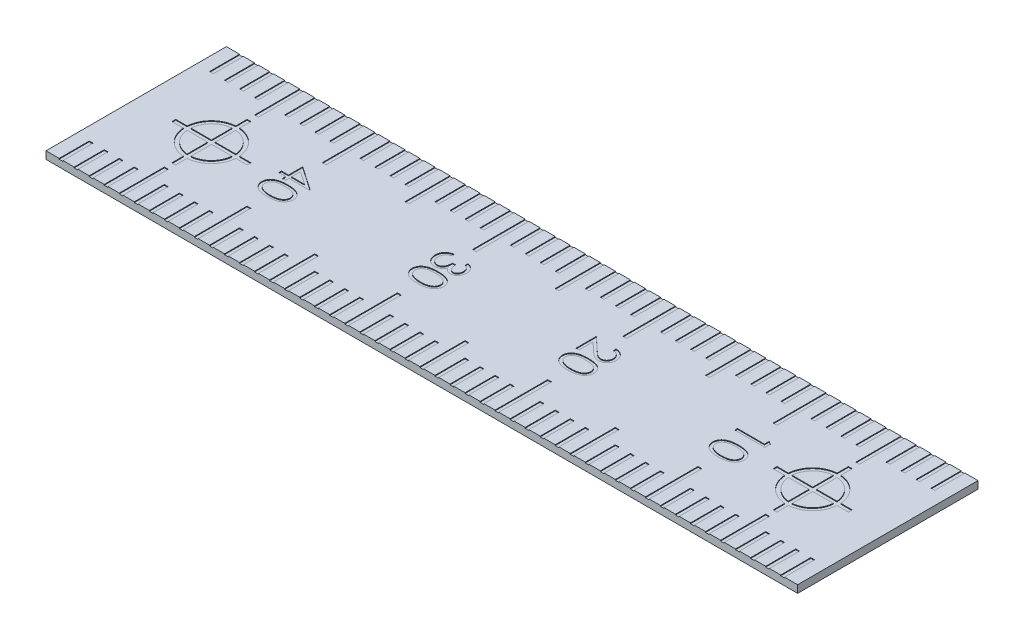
from build123d import *

# Parameters (mm, degrees)
SKETCH1_W                = 50
SKETCH1_H                = 12
BOSS_EXTRUDE1_DEPTH      = 0.5
SKETCH2_W                = 0.25
SKETCH2_H                = 2
CUT_EXTRUDE2_DEPTH       = 0.05
LPATTERN2_COUNT          = 49
LPATTERN2_PITCH          = 1
SKETCH3_W                = 0.25
SKETCH3_H                = 1.5
CUT_EXTRUDE3_DEPTH       = 0.05
LPATTERN3_COUNT          = 4
LPATTERN3_PITCH          = 10
SKETCH4_W                = 0.25
SKETCH4_H                = 1
CUT_EXTRUDE4_DEPTH       = 0.05
LPATTERN4_COUNT          = 4
LPATTERN4_PITCH          = 10
LPATTERN4_COL_COUNT      = 2
LPATTERN4_COL_PITCH      = 10
CUT_EXTRUDE6_DEPTH       = 0.05
LPATTERN5_COUNT          = 2
LPATTERN5_PITCH          = 40
MIRROR1_COPY_1_SKETCH_W  = 0.25
MIRROR1_COPY_1_SKETCH_H  = 2
MIRROR1_COPY_1_DEPTH     = 0.05
MIRROR1_COPY_2_SKETCH_W  = 0.25
MIRROR1_COPY_2_SKETCH_H  = 2
MIRROR1_COPY_2_DEPTH     = 0.05
MIRROR1_COPY_3_SKETCH_W  = 0.25
MIRROR1_COPY_3_SKETCH_H  = 2
MIRROR1_COPY_3_DEPTH     = 0.05
MIRROR1_COPY_4_SKETCH_W  = 0.25
MIRROR1_COPY_4_SKETCH_H  = 2
MIRROR1_COPY_4_DEPTH     = 0.05
MIRROR1_COPY_5_SKETCH_W  = 0.25
MIRROR1_COPY_5_SKETCH_H  = 2
MIRROR1_COPY_5_DEPTH     = 0.05
MIRROR1_COPY_6_SKETCH_W  = 0.25
MIRROR1_COPY_6_SKETCH_H  = 2
MIRROR1_COPY_6_DEPTH     = 0.05
MIRROR1_COPY_7_SKETCH_W  = 0.25
MIRROR1_COPY_7_SKETCH_H  = 2
MIRROR1_COPY_7_DEPTH     = 0.05
MIRROR1_COPY_8_SKETCH_W  = 0.25
MIRROR1_COPY_8_SKETCH_H  = 2
MIRROR1_COPY_8_DEPTH     = 0.05
MIRROR1_COPY_9_SKETCH_W  = 0.25
MIRROR1_COPY_9_SKETCH_H  = 2
MIRROR1_COPY_9_DEPTH     = 0.05
MIRROR1_COPY_10_SKETCH_W = 0.25
MIRROR1_COPY_10_SKETCH_H = 2
MIRROR1_COPY_10_DEPTH    = 0.05
MIRROR1_COPY_11_SKETCH_W = 0.25
MIRROR1_COPY_11_SKETCH_H = 2
MIRROR1_COPY_11_DEPTH    = 0.05
MIRROR1_COPY_12_SKETCH_W = 0.25
MIRROR1_COPY_12_SKETCH_H = 2
MIRROR1_COPY_12_DEPTH    = 0.05
MIRROR1_COPY_13_SKETCH_W = 0.25
MIRROR1_COPY_13_SKETCH_H = 2
MIRROR1_COPY_13_DEPTH    = 0.05
MIRROR1_COPY_14_SKETCH_W = 0.25
MIRROR1_COPY_14_SKETCH_H = 2
MIRROR1_COPY_14_DEPTH    = 0.05
MIRROR1_COPY_15_SKETCH_W = 0.25
MIRROR1_COPY_15_SKETCH_H = 2
MIRROR1_COPY_15_DEPTH    = 0.05
MIRROR1_COPY_16_SKETCH_W = 0.25
MIRROR1_COPY_16_SKETCH_H = 2
MIRROR1_COPY_16_DEPTH    = 0.05
MIRROR1_COPY_17_SKETCH_W = 0.25
MIRROR1_COPY_17_SKETCH_H = 2
MIRROR1_COPY_17_DEPTH    = 0.05
MIRROR1_COPY_18_SKETCH_W = 0.25
MIRROR1_COPY_18_SKETCH_H = 2
MIRROR1_COPY_18_DEPTH    = 0.05
MIRROR1_COPY_19_SKETCH_W = 0.25
MIRROR1_COPY_19_SKETCH_H = 2
MIRROR1_COPY_19_DEPTH    = 0.05
MIRROR1_COPY_20_SKETCH_W = 0.25
MIRROR1_COPY_20_SKETCH_H = 2
MIRROR1_COPY_20_DEPTH    = 0.05
MIRROR1_COPY_21_SKETCH_W = 0.25
MIRROR1_COPY_21_SKETCH_H = 2
MIRROR1_COPY_21_DEPTH    = 0.05
MIRROR1_COPY_22_SKETCH_W = 0.25
MIRROR1_COPY_22_SKETCH_H = 2
MIRROR1_COPY_22_DEPTH    = 0.05
MIRROR1_COPY_23_SKETCH_W = 0.25
MIRROR1_COPY_23_SKETCH_H = 2
MIRROR1_COPY_23_DEPTH    = 0.05
MIRROR1_COPY_24_SKETCH_W = 0.25
MIRROR1_COPY_24_SKETCH_H = 2
MIRROR1_COPY_24_DEPTH    = 0.05
MIRROR1_COPY_25_SKETCH_W = 0.25
MIRROR1_COPY_25_SKETCH_H = 2
MIRROR1_COPY_25_DEPTH    = 0.05
MIRROR1_COPY_26_SKETCH_W = 0.25
MIRROR1_COPY_26_SKETCH_H = 2
MIRROR1_COPY_26_DEPTH    = 0.05
MIRROR1_COPY_27_SKETCH_W = 0.25
MIRROR1_COPY_27_SKETCH_H = 2
MIRROR1_COPY_27_DEPTH    = 0.05
MIRROR1_COPY_28_SKETCH_W = 0.25
MIRROR1_COPY_28_SKETCH_H = 2
MIRROR1_COPY_28_DEPTH    = 0.05
MIRROR1_COPY_29_SKETCH_W = 0.25
MIRROR1_COPY_29_SKETCH_H = 2
MIRROR1_COPY_29_DEPTH    = 0.05
MIRROR1_COPY_30_SKETCH_W = 0.25
MIRROR1_COPY_30_SKETCH_H = 2
MIRROR1_COPY_30_DEPTH    = 0.05
MIRROR1_COPY_31_SKETCH_W = 0.25
MIRROR1_COPY_31_SKETCH_H = 2
MIRROR1_COPY_31_DEPTH    = 0.05
MIRROR1_COPY_32_SKETCH_W = 0.25
MIRROR1_COPY_32_SKETCH_H = 2
MIRROR1_COPY_32_DEPTH    = 0.05
MIRROR1_COPY_33_SKETCH_W = 0.25
MIRROR1_COPY_33_SKETCH_H = 2
MIRROR1_COPY_33_DEPTH    = 0.05
MIRROR1_COPY_34_SKETCH_W = 0.25
MIRROR1_COPY_34_SKETCH_H = 2
MIRROR1_COPY_34_DEPTH    = 0.05
MIRROR1_COPY_35_SKETCH_W = 0.25
MIRROR1_COPY_35_SKETCH_H = 2
MIRROR1_COPY_35_DEPTH    = 0.05
MIRROR1_COPY_36_SKETCH_W = 0.25
MIRROR1_COPY_36_SKETCH_H = 2
MIRROR1_COPY_36_DEPTH    = 0.05
MIRROR1_COPY_37_SKETCH_W = 0.25
MIRROR1_COPY_37_SKETCH_H = 2
MIRROR1_COPY_37_DEPTH    = 0.05
MIRROR1_COPY_38_SKETCH_W = 0.25
MIRROR1_COPY_38_SKETCH_H = 2
MIRROR1_COPY_38_DEPTH    = 0.05
MIRROR1_COPY_39_SKETCH_W = 0.25
MIRROR1_COPY_39_SKETCH_H = 2
MIRROR1_COPY_39_DEPTH    = 0.05
MIRROR1_COPY_40_SKETCH_W = 0.25
MIRROR1_COPY_40_SKETCH_H = 2
MIRROR1_COPY_40_DEPTH    = 0.05
MIRROR1_COPY_41_SKETCH_W = 0.25
MIRROR1_COPY_41_SKETCH_H = 2
MIRROR1_COPY_41_DEPTH    = 0.05
MIRROR1_COPY_42_SKETCH_W = 0.25
MIRROR1_COPY_42_SKETCH_H = 2
MIRROR1_COPY_42_DEPTH    = 0.05
MIRROR1_COPY_43_SKETCH_W = 0.25
MIRROR1_COPY_43_SKETCH_H = 2
MIRROR1_COPY_43_DEPTH    = 0.05
MIRROR1_COPY_44_SKETCH_W = 0.25
MIRROR1_COPY_44_SKETCH_H = 2
MIRROR1_COPY_44_DEPTH    = 0.05
MIRROR1_COPY_45_SKETCH_W = 0.25
MIRROR1_COPY_45_SKETCH_H = 2
MIRROR1_COPY_45_DEPTH    = 0.05
MIRROR1_COPY_46_SKETCH_W = 0.25
MIRROR1_COPY_46_SKETCH_H = 2
MIRROR1_COPY_46_DEPTH    = 0.05
MIRROR1_COPY_47_SKETCH_W = 0.25
MIRROR1_COPY_47_SKETCH_H = 2
MIRROR1_COPY_47_DEPTH    = 0.05
MIRROR1_COPY_48_SKETCH_W = 0.25
MIRROR1_COPY_48_SKETCH_H = 2
MIRROR1_COPY_48_DEPTH    = 0.05
MIRROR1_COPY_49_SKETCH_W = 0.25
MIRROR1_COPY_49_SKETCH_H = 1.5
MIRROR1_COPY_49_DEPTH    = 0.05
MIRROR1_COPY_50_SKETCH_W = 0.25
MIRROR1_COPY_50_SKETCH_H = 1.5
MIRROR1_COPY_50_DEPTH    = 0.05
MIRROR1_COPY_51_SKETCH_W = 0.25
MIRROR1_COPY_51_SKETCH_H = 1.5
MIRROR1_COPY_51_DEPTH    = 0.05
MIRROR1_COPY_52_SKETCH_W = 0.25
MIRROR1_COPY_52_SKETCH_H = 1
MIRROR1_COPY_52_DEPTH    = 0.05
MIRROR1_COPY_53_SKETCH_W = 0.25
MIRROR1_COPY_53_SKETCH_H = 1
MIRROR1_COPY_53_DEPTH    = 0.05
MIRROR1_COPY_54_SKETCH_W = 0.25
MIRROR1_COPY_54_SKETCH_H = 1
MIRROR1_COPY_54_DEPTH    = 0.05
MIRROR1_COPY_55_SKETCH_W = 0.25
MIRROR1_COPY_55_SKETCH_H = 1
MIRROR1_COPY_55_DEPTH    = 0.05
CUT_EXTRUDE18_DEPTH      = 0.05


with BuildPart() as part:
    # Sketch1 → Boss-Extrude1 (new body)
    with BuildSketch(Plane(origin=(0, 0, 0), x_dir=(1, 0, 0), z_dir=(0, 1, 0))):
        Rectangle(SKETCH1_W, SKETCH1_H)
    extrude(amount=-BOSS_EXTRUDE1_DEPTH)

    # Sketch2 → Cut-Extrude2 (cut)
    with BuildSketch(Plane(origin=(0, 0, 0), x_dir=(1, 0, 0), z_dir=(0, 1, 0))):
        with Locations((-24, 5)):
            Rectangle(SKETCH2_W, SKETCH2_H)
    cut_extrude2 = extrude(amount=-CUT_EXTRUDE2_DEPTH, mode=Mode.SUBTRACT)

    # LPattern2: Cut-Extrude2 ×49
    with Locations(*[(i * LPATTERN2_PITCH, 0, 0) for i in range(1, LPATTERN2_COUNT)]):
        add(cut_extrude2, mode=Mode.SUBTRACT)

    # Sketch3 → Cut-Extrude3 (cut)
    with BuildSketch(Plane(origin=(0, 0, 0), x_dir=(1, 0, 0), z_dir=(0, 1, 0))):
        with Locations((-15, 3.25)):
            Rectangle(SKETCH3_W, SKETCH3_H)
    cut_extrude3 = extrude(amount=-CUT_EXTRUDE3_DEPTH, mode=Mode.SUBTRACT)

    # LPattern3: Cut-Extrude3 ×4
    with Locations(*[(i * LPATTERN3_PITCH, 0, 0) for i in range(1, LPATTERN3_COUNT)]):
        add(cut_extrude3, mode=Mode.SUBTRACT)

    # Sketch4 → Cut-Extrude4 (cut)
    with BuildSketch(Plane(origin=(0, 0, 0), x_dir=(1, 0, 0), z_dir=(0, 1, 0))):
        with Locations((-10, 3.5)):
            Rectangle(SKETCH4_W, SKETCH4_H)
    cut_extrude4 = extrude(amount=-CUT_EXTRUDE4_DEPTH, mode=Mode.SUBTRACT)

    # LPattern4: Cut-Extrude4 ×4
    with Locations(*[(i * LPATTERN4_PITCH, 0, 0) for i in range(1, LPATTERN4_COUNT)]):
        add(cut_extrude4, mode=Mode.SUBTRACT)

    # LPattern4 col: Cut-Extrude4 ×2
    with Locations(*[(-i * LPATTERN4_COL_PITCH, 0, 0) for i in range(1, LPATTERN4_COL_COUNT)]):
        add(cut_extrude4, mode=Mode.SUBTRACT)

    # Sketch5 → Cut-Extrude6 (cut)
    with BuildSketch(Plane(origin=(0, 0, 0), x_dir=(1, 0, 0), z_dir=(0, 1, 0))):
        with BuildLine():
            Line((-20.12, 2.5), (-19.87, 2.5))
            Line((-19.87, 2.5), (-19.87, 1.745530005))
            ThreePointArc((-19.87, 1.745530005), (-18.757563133, 1.237436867), (-18.249469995, 0.125))
            Line((-18.249469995, 0.125), (-17.495, 0.125))
            Line((-17.495, 0.125), (-17.495, -0.125))
            Line((-17.495, -0.125), (-18.249469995, -0.125))
            ThreePointArc((-18.249469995, -0.125), (-18.757563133, -1.237436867), (-19.87, -1.745530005))
            Line((-19.87, -1.745530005), (-19.87, -2.5))
            Line((-19.87, -2.5), (-20.12, -2.5))
            Line((-20.12, -2.5), (-20.12, -1.745530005))
            ThreePointArc((-20.12, -1.745530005), (-21.232436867, -1.237436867), (-21.740530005, -0.125))
            Line((-21.740530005, -0.125), (-22.495, -0.125))
            Line((-22.495, -0.125), (-22.495, 0.125))
            Line((-22.495, 0.125), (-21.740530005, 0.125))
            ThreePointArc((-21.740530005, 0.125), (-21.232436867, 1.237436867), (-20.12, 1.745530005))
            Line((-20.12, 1.745530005), (-20.12, 2.5))
        make_face()
        with BuildLine():
            Line((-20.12, 1.494782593), (-20.12, 0.125))
            Line((-20.12, 0.125), (-21.489782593, 0.125))
            ThreePointArc((-21.489782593, 0.125), (-21.055660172, 1.060660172), (-20.12, 1.494782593))
        make_face(mode=Mode.SUBTRACT)
        with BuildLine():
            Line((-19.87, 1.494782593), (-19.87, 0.125))
            Line((-19.87, 0.125), (-18.500217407, 0.125))
            ThreePointArc((-18.500217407, 0.125), (-18.934339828, 1.060660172), (-19.87, 1.494782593))
        make_face(mode=Mode.SUBTRACT)
        with BuildLine():
            Line((-21.489782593, -0.125), (-20.12, -0.125))
            Line((-20.12, -0.125), (-20.12, -1.494782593))
            ThreePointArc((-20.12, -1.494782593), (-21.055660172, -1.060660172), (-21.489782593, -0.125))
        make_face(mode=Mode.SUBTRACT)
        with BuildLine():
            Line((-19.87, -0.125), (-19.87, -1.494782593))
            ThreePointArc((-19.87, -1.494782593), (-18.934339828, -1.060660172), (-18.500217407, -0.125))
            Line((-18.500217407, -0.125), (-19.87, -0.125))
        make_face(mode=Mode.SUBTRACT)
    cut_extrude6 = extrude(amount=-CUT_EXTRUDE6_DEPTH, mode=Mode.SUBTRACT)

    # LPattern5: Cut-Extrude6 ×2
    with Locations(*[(i * LPATTERN5_PITCH, 0, 0) for i in range(1, LPATTERN5_COUNT)]):
        add(cut_extrude6, mode=Mode.SUBTRACT)

    # Mirror1: Cut-Extrude2, Cut-Extrude3, Cut-Extrude4 across plane
    add(cut_extrude2.mirror(Plane.XY), mode=Mode.SUBTRACT)
    add(cut_extrude3.mirror(Plane.XY), mode=Mode.SUBTRACT)
    add(cut_extrude4.mirror(Plane.XY), mode=Mode.SUBTRACT)

    # Mirror1 copy 1 sketch → Mirror1 copy 1 (cut)
    with BuildSketch(Plane(origin=(1, 0, 0), x_dir=(1, 0, 0), z_dir=(0, 1, 0))):
        with Locations((-24, -5)):
            Rectangle(MIRROR1_COPY_1_SKETCH_W, MIRROR1_COPY_1_SKETCH_H)
    extrude(amount=-MIRROR1_COPY_1_DEPTH, mode=Mode.SUBTRACT)

    # Mirror1 copy 2 sketch → Mirror1 copy 2 (cut)
    with BuildSketch(Plane(origin=(2, 0, 0), x_dir=(1, 0, 0), z_dir=(0, 1, 0))):
        with Locations((-24, -5)):
            Rectangle(MIRROR1_COPY_2_SKETCH_W, MIRROR1_COPY_2_SKETCH_H)
    extrude(amount=-MIRROR1_COPY_2_DEPTH, mode=Mode.SUBTRACT)

    # Mirror1 copy 3 sketch → Mirror1 copy 3 (cut)
    with BuildSketch(Plane(origin=(3, 0, 0), x_dir=(1, 0, 0), z_dir=(0, 1, 0))):
        with Locations((-24, -5)):
            Rectangle(MIRROR1_COPY_3_SKETCH_W, MIRROR1_COPY_3_SKETCH_H)
    extrude(amount=-MIRROR1_COPY_3_DEPTH, mode=Mode.SUBTRACT)

    # Mirror1 copy 4 sketch → Mirror1 copy 4 (cut)
    with BuildSketch(Plane(origin=(4, 0, 0), x_dir=(1, 0, 0), z_dir=(0, 1, 0))):
        with Locations((-24, -5)):
            Rectangle(MIRROR1_COPY_4_SKETCH_W, MIRROR1_COPY_4_SKETCH_H)
    extrude(amount=-MIRROR1_COPY_4_DEPTH, mode=Mode.SUBTRACT)

    # Mirror1 copy 5 sketch → Mirror1 copy 5 (cut)
    with BuildSketch(Plane(origin=(5, 0, 0), x_dir=(1, 0, 0), z_dir=(0, 1, 0))):
        with Locations((-24, -5)):
            Rectangle(MIRROR1_COPY_5_SKETCH_W, MIRROR1_COPY_5_SKETCH_H)
    extrude(amount=-MIRROR1_COPY_5_DEPTH, mode=Mode.SUBTRACT)

    # Mirror1 copy 6 sketch → Mirror1 copy 6 (cut)
    with BuildSketch(Plane(origin=(6, 0, 0), x_dir=(1, 0, 0), z_dir=(0, 1, 0))):
        with Locations((-24, -5)):
            Rectangle(MIRROR1_COPY_6_SKETCH_W, MIRROR1_COPY_6_SKETCH_H)
    extrude(amount=-MIRROR1_COPY_6_DEPTH, mode=Mode.SUBTRACT)

    # Mirror1 copy 7 sketch → Mirror1 copy 7 (cut)
    with BuildSketch(Plane(origin=(7, 0, 0), x_dir=(1, 0, 0), z_dir=(0, 1, 0))):
        with Locations((-24, -5)):
            Rectangle(MIRROR1_COPY_7_SKETCH_W, MIRROR1_COPY_7_SKETCH_H)
    extrude(amount=-MIRROR1_COPY_7_DEPTH, mode=Mode.SUBTRACT)

    # Mirror1 copy 8 sketch → Mirror1 copy 8 (cut)
    with BuildSketch(Plane(origin=(8, 0, 0), x_dir=(1, 0, 0), z_dir=(0, 1, 0))):
        with Locations((-24, -5)):
            Rectangle(MIRROR1_COPY_8_SKETCH_W, MIRROR1_COPY_8_SKETCH_H)
    extrude(amount=-MIRROR1_COPY_8_DEPTH, mode=Mode.SUBTRACT)

    # Mirror1 copy 9 sketch → Mirror1 copy 9 (cut)
    with BuildSketch(Plane(origin=(9, 0, 0), x_dir=(1, 0, 0), z_dir=(0, 1, 0))):
        with Locations((-24, -5)):
            Rectangle(MIRROR1_COPY_9_SKETCH_W, MIRROR1_COPY_9_SKETCH_H)
    extrude(amount=-MIRROR1_COPY_9_DEPTH, mode=Mode.SUBTRACT)

    # Mirror1 copy 10 sketch → Mirror1 copy 10 (cut)
    with BuildSketch(Plane(origin=(10, 0, 0), x_dir=(1, 0, 0), z_dir=(0, 1, 0))):
        with Locations((-24, -5)):
            Rectangle(MIRROR1_COPY_10_SKETCH_W, MIRROR1_COPY_10_SKETCH_H)
    extrude(amount=-MIRROR1_COPY_10_DEPTH, mode=Mode.SUBTRACT)

    # Mirror1 copy 11 sketch → Mirror1 copy 11 (cut)
    with BuildSketch(Plane(origin=(11, 0, 0), x_dir=(1, 0, 0), z_dir=(0, 1, 0))):
        with Locations((-24, -5)):
            Rectangle(MIRROR1_COPY_11_SKETCH_W, MIRROR1_COPY_11_SKETCH_H)
    extrude(amount=-MIRROR1_COPY_11_DEPTH, mode=Mode.SUBTRACT)

    # Mirror1 copy 12 sketch → Mirror1 copy 12 (cut)
    with BuildSketch(Plane(origin=(12, 0, 0), x_dir=(1, 0, 0), z_dir=(0, 1, 0))):
        with Locations((-24, -5)):
            Rectangle(MIRROR1_COPY_12_SKETCH_W, MIRROR1_COPY_12_SKETCH_H)
    extrude(amount=-MIRROR1_COPY_12_DEPTH, mode=Mode.SUBTRACT)

    # Mirror1 copy 13 sketch → Mirror1 copy 13 (cut)
    with BuildSketch(Plane(origin=(13, 0, 0), x_dir=(1, 0, 0), z_dir=(0, 1, 0))):
        with Locations((-24, -5)):
            Rectangle(MIRROR1_COPY_13_SKETCH_W, MIRROR1_COPY_13_SKETCH_H)
    extrude(amount=-MIRROR1_COPY_13_DEPTH, mode=Mode.SUBTRACT)

    # Mirror1 copy 14 sketch → Mirror1 copy 14 (cut)
    with BuildSketch(Plane(origin=(14, 0, 0), x_dir=(1, 0, 0), z_dir=(0, 1, 0))):
        with Locations((-24, -5)):
            Rectangle(MIRROR1_COPY_14_SKETCH_W, MIRROR1_COPY_14_SKETCH_H)
    extrude(amount=-MIRROR1_COPY_14_DEPTH, mode=Mode.SUBTRACT)

    # Mirror1 copy 15 sketch → Mirror1 copy 15 (cut)
    with BuildSketch(Plane(origin=(15, 0, 0), x_dir=(1, 0, 0), z_dir=(0, 1, 0))):
        with Locations((-24, -5)):
            Rectangle(MIRROR1_COPY_15_SKETCH_W, MIRROR1_COPY_15_SKETCH_H)
    extrude(amount=-MIRROR1_COPY_15_DEPTH, mode=Mode.SUBTRACT)

    # Mirror1 copy 16 sketch → Mirror1 copy 16 (cut)
    with BuildSketch(Plane(origin=(16, 0, 0), x_dir=(1, 0, 0), z_dir=(0, 1, 0))):
        with Locations((-24, -5)):
            Rectangle(MIRROR1_COPY_16_SKETCH_W, MIRROR1_COPY_16_SKETCH_H)
    extrude(amount=-MIRROR1_COPY_16_DEPTH, mode=Mode.SUBTRACT)

    # Mirror1 copy 17 sketch → Mirror1 copy 17 (cut)
    with BuildSketch(Plane(origin=(17, 0, 0), x_dir=(1, 0, 0), z_dir=(0, 1, 0))):
        with Locations((-24, -5)):
            Rectangle(MIRROR1_COPY_17_SKETCH_W, MIRROR1_COPY_17_SKETCH_H)
    extrude(amount=-MIRROR1_COPY_17_DEPTH, mode=Mode.SUBTRACT)

    # Mirror1 copy 18 sketch → Mirror1 copy 18 (cut)
    with BuildSketch(Plane(origin=(18, 0, 0), x_dir=(1, 0, 0), z_dir=(0, 1, 0))):
        with Locations((-24, -5)):
            Rectangle(MIRROR1_COPY_18_SKETCH_W, MIRROR1_COPY_18_SKETCH_H)
    extrude(amount=-MIRROR1_COPY_18_DEPTH, mode=Mode.SUBTRACT)

    # Mirror1 copy 19 sketch → Mirror1 copy 19 (cut)
    with BuildSketch(Plane(origin=(19, 0, 0), x_dir=(1, 0, 0), z_dir=(0, 1, 0))):
        with Locations((-24, -5)):
            Rectangle(MIRROR1_COPY_19_SKETCH_W, MIRROR1_COPY_19_SKETCH_H)
    extrude(amount=-MIRROR1_COPY_19_DEPTH, mode=Mode.SUBTRACT)

    # Mirror1 copy 20 sketch → Mirror1 copy 20 (cut)
    with BuildSketch(Plane(origin=(20, 0, 0), x_dir=(1, 0, 0), z_dir=(0, 1, 0))):
        with Locations((-24, -5)):
            Rectangle(MIRROR1_COPY_20_SKETCH_W, MIRROR1_COPY_20_SKETCH_H)
    extrude(amount=-MIRROR1_COPY_20_DEPTH, mode=Mode.SUBTRACT)

    # Mirror1 copy 21 sketch → Mirror1 copy 21 (cut)
    with BuildSketch(Plane(origin=(21, 0, 0), x_dir=(1, 0, 0), z_dir=(0, 1, 0))):
        with Locations((-24, -5)):
            Rectangle(MIRROR1_COPY_21_SKETCH_W, MIRROR1_COPY_21_SKETCH_H)
    extrude(amount=-MIRROR1_COPY_21_DEPTH, mode=Mode.SUBTRACT)

    # Mirror1 copy 22 sketch → Mirror1 copy 22 (cut)
    with BuildSketch(Plane(origin=(22, 0, 0), x_dir=(1, 0, 0), z_dir=(0, 1, 0))):
        with Locations((-24, -5)):
            Rectangle(MIRROR1_COPY_22_SKETCH_W, MIRROR1_COPY_22_SKETCH_H)
    extrude(amount=-MIRROR1_COPY_22_DEPTH, mode=Mode.SUBTRACT)

    # Mirror1 copy 23 sketch → Mirror1 copy 23 (cut)
    with BuildSketch(Plane(origin=(23, 0, 0), x_dir=(1, 0, 0), z_dir=(0, 1, 0))):
        with Locations((-24, -5)):
            Rectangle(MIRROR1_COPY_23_SKETCH_W, MIRROR1_COPY_23_SKETCH_H)
    extrude(amount=-MIRROR1_COPY_23_DEPTH, mode=Mode.SUBTRACT)

    # Mirror1 copy 24 sketch → Mirror1 copy 24 (cut)
    with BuildSketch(Plane(origin=(24, 0, 0), x_dir=(1, 0, 0), z_dir=(0, 1, 0))):
        with Locations((-24, -5)):
            Rectangle(MIRROR1_COPY_24_SKETCH_W, MIRROR1_COPY_24_SKETCH_H)
    extrude(amount=-MIRROR1_COPY_24_DEPTH, mode=Mode.SUBTRACT)

    # Mirror1 copy 25 sketch → Mirror1 copy 25 (cut)
    with BuildSketch(Plane(origin=(25, 0, 0), x_dir=(1, 0, 0), z_dir=(0, 1, 0))):
        with Locations((-24, -5)):
            Rectangle(MIRROR1_COPY_25_SKETCH_W, MIRROR1_COPY_25_SKETCH_H)
    extrude(amount=-MIRROR1_COPY_25_DEPTH, mode=Mode.SUBTRACT)

    # Mirror1 copy 26 sketch → Mirror1 copy 26 (cut)
    with BuildSketch(Plane(origin=(26, 0, 0), x_dir=(1, 0, 0), z_dir=(0, 1, 0))):
        with Locations((-24, -5)):
            Rectangle(MIRROR1_COPY_26_SKETCH_W, MIRROR1_COPY_26_SKETCH_H)
    extrude(amount=-MIRROR1_COPY_26_DEPTH, mode=Mode.SUBTRACT)

    # Mirror1 copy 27 sketch → Mirror1 copy 27 (cut)
    with BuildSketch(Plane(origin=(27, 0, 0), x_dir=(1, 0, 0), z_dir=(0, 1, 0))):
        with Locations((-24, -5)):
            Rectangle(MIRROR1_COPY_27_SKETCH_W, MIRROR1_COPY_27_SKETCH_H)
    extrude(amount=-MIRROR1_COPY_27_DEPTH, mode=Mode.SUBTRACT)

    # Mirror1 copy 28 sketch → Mirror1 copy 28 (cut)
    with BuildSketch(Plane(origin=(28, 0, 0), x_dir=(1, 0, 0), z_dir=(0, 1, 0))):
        with Locations((-24, -5)):
            Rectangle(MIRROR1_COPY_28_SKETCH_W, MIRROR1_COPY_28_SKETCH_H)
    extrude(amount=-MIRROR1_COPY_28_DEPTH, mode=Mode.SUBTRACT)

    # Mirror1 copy 29 sketch → Mirror1 copy 29 (cut)
    with BuildSketch(Plane(origin=(29, 0, 0), x_dir=(1, 0, 0), z_dir=(0, 1, 0))):
        with Locations((-24, -5)):
            Rectangle(MIRROR1_COPY_29_SKETCH_W, MIRROR1_COPY_29_SKETCH_H)
    extrude(amount=-MIRROR1_COPY_29_DEPTH, mode=Mode.SUBTRACT)

    # Mirror1 copy 30 sketch → Mirror1 copy 30 (cut)
    with BuildSketch(Plane(origin=(30, 0, 0), x_dir=(1, 0, 0), z_dir=(0, 1, 0))):
        with Locations((-24, -5)):
            Rectangle(MIRROR1_COPY_30_SKETCH_W, MIRROR1_COPY_30_SKETCH_H)
    extrude(amount=-MIRROR1_COPY_30_DEPTH, mode=Mode.SUBTRACT)

    # Mirror1 copy 31 sketch → Mirror1 copy 31 (cut)
    with BuildSketch(Plane(origin=(31, 0, 0), x_dir=(1, 0, 0), z_dir=(0, 1, 0))):
        with Locations((-24, -5)):
            Rectangle(MIRROR1_COPY_31_SKETCH_W, MIRROR1_COPY_31_SKETCH_H)
    extrude(amount=-MIRROR1_COPY_31_DEPTH, mode=Mode.SUBTRACT)

    # Mirror1 copy 32 sketch → Mirror1 copy 32 (cut)
    with BuildSketch(Plane(origin=(32, 0, 0), x_dir=(1, 0, 0), z_dir=(0, 1, 0))):
        with Locations((-24, -5)):
            Rectangle(MIRROR1_COPY_32_SKETCH_W, MIRROR1_COPY_32_SKETCH_H)
    extrude(amount=-MIRROR1_COPY_32_DEPTH, mode=Mode.SUBTRACT)

    # Mirror1 copy 33 sketch → Mirror1 copy 33 (cut)
    with BuildSketch(Plane(origin=(33, 0, 0), x_dir=(1, 0, 0), z_dir=(0, 1, 0))):
        with Locations((-24, -5)):
            Rectangle(MIRROR1_COPY_33_SKETCH_W, MIRROR1_COPY_33_SKETCH_H)
    extrude(amount=-MIRROR1_COPY_33_DEPTH, mode=Mode.SUBTRACT)

    # Mirror1 copy 34 sketch → Mirror1 copy 34 (cut)
    with BuildSketch(Plane(origin=(34, 0, 0), x_dir=(1, 0, 0), z_dir=(0, 1, 0))):
        with Locations((-24, -5)):
            Rectangle(MIRROR1_COPY_34_SKETCH_W, MIRROR1_COPY_34_SKETCH_H)
    extrude(amount=-MIRROR1_COPY_34_DEPTH, mode=Mode.SUBTRACT)

    # Mirror1 copy 35 sketch → Mirror1 copy 35 (cut)
    with BuildSketch(Plane(origin=(35, 0, 0), x_dir=(1, 0, 0), z_dir=(0, 1, 0))):
        with Locations((-24, -5)):
            Rectangle(MIRROR1_COPY_35_SKETCH_W, MIRROR1_COPY_35_SKETCH_H)
    extrude(amount=-MIRROR1_COPY_35_DEPTH, mode=Mode.SUBTRACT)

    # Mirror1 copy 36 sketch → Mirror1 copy 36 (cut)
    with BuildSketch(Plane(origin=(36, 0, 0), x_dir=(1, 0, 0), z_dir=(0, 1, 0))):
        with Locations((-24, -5)):
            Rectangle(MIRROR1_COPY_36_SKETCH_W, MIRROR1_COPY_36_SKETCH_H)
    extrude(amount=-MIRROR1_COPY_36_DEPTH, mode=Mode.SUBTRACT)

    # Mirror1 copy 37 sketch → Mirror1 copy 37 (cut)
    with BuildSketch(Plane(origin=(37, 0, 0), x_dir=(1, 0, 0), z_dir=(0, 1, 0))):
        with Locations((-24, -5)):
            Rectangle(MIRROR1_COPY_37_SKETCH_W, MIRROR1_COPY_37_SKETCH_H)
    extrude(amount=-MIRROR1_COPY_37_DEPTH, mode=Mode.SUBTRACT)

    # Mirror1 copy 38 sketch → Mirror1 copy 38 (cut)
    with BuildSketch(Plane(origin=(38, 0, 0), x_dir=(1, 0, 0), z_dir=(0, 1, 0))):
        with Locations((-24, -5)):
            Rectangle(MIRROR1_COPY_38_SKETCH_W, MIRROR1_COPY_38_SKETCH_H)
    extrude(amount=-MIRROR1_COPY_38_DEPTH, mode=Mode.SUBTRACT)

    # Mirror1 copy 39 sketch → Mirror1 copy 39 (cut)
    with BuildSketch(Plane(origin=(39, 0, 0), x_dir=(1, 0, 0), z_dir=(0, 1, 0))):
        with Locations((-24, -5)):
            Rectangle(MIRROR1_COPY_39_SKETCH_W, MIRROR1_COPY_39_SKETCH_H)
    extrude(amount=-MIRROR1_COPY_39_DEPTH, mode=Mode.SUBTRACT)

    # Mirror1 copy 40 sketch → Mirror1 copy 40 (cut)
    with BuildSketch(Plane(origin=(40, 0, 0), x_dir=(1, 0, 0), z_dir=(0, 1, 0))):
        with Locations((-24, -5)):
            Rectangle(MIRROR1_COPY_40_SKETCH_W, MIRROR1_COPY_40_SKETCH_H)
    extrude(amount=-MIRROR1_COPY_40_DEPTH, mode=Mode.SUBTRACT)

    # Mirror1 copy 41 sketch → Mirror1 copy 41 (cut)
    with BuildSketch(Plane(origin=(41, 0, 0), x_dir=(1, 0, 0), z_dir=(0, 1, 0))):
        with Locations((-24, -5)):
            Rectangle(MIRROR1_COPY_41_SKETCH_W, MIRROR1_COPY_41_SKETCH_H)
    extrude(amount=-MIRROR1_COPY_41_DEPTH, mode=Mode.SUBTRACT)

    # Mirror1 copy 42 sketch → Mirror1 copy 42 (cut)
    with BuildSketch(Plane(origin=(42, 0, 0), x_dir=(1, 0, 0), z_dir=(0, 1, 0))):
        with Locations((-24, -5)):
            Rectangle(MIRROR1_COPY_42_SKETCH_W, MIRROR1_COPY_42_SKETCH_H)
    extrude(amount=-MIRROR1_COPY_42_DEPTH, mode=Mode.SUBTRACT)

    # Mirror1 copy 43 sketch → Mirror1 copy 43 (cut)
    with BuildSketch(Plane(origin=(43, 0, 0), x_dir=(1, 0, 0), z_dir=(0, 1, 0))):
        with Locations((-24, -5)):
            Rectangle(MIRROR1_COPY_43_SKETCH_W, MIRROR1_COPY_43_SKETCH_H)
    extrude(amount=-MIRROR1_COPY_43_DEPTH, mode=Mode.SUBTRACT)

    # Mirror1 copy 44 sketch → Mirror1 copy 44 (cut)
    with BuildSketch(Plane(origin=(44, 0, 0), x_dir=(1, 0, 0), z_dir=(0, 1, 0))):
        with Locations((-24, -5)):
            Rectangle(MIRROR1_COPY_44_SKETCH_W, MIRROR1_COPY_44_SKETCH_H)
    extrude(amount=-MIRROR1_COPY_44_DEPTH, mode=Mode.SUBTRACT)

    # Mirror1 copy 45 sketch → Mirror1 copy 45 (cut)
    with BuildSketch(Plane(origin=(45, 0, 0), x_dir=(1, 0, 0), z_dir=(0, 1, 0))):
        with Locations((-24, -5)):
            Rectangle(MIRROR1_COPY_45_SKETCH_W, MIRROR1_COPY_45_SKETCH_H)
    extrude(amount=-MIRROR1_COPY_45_DEPTH, mode=Mode.SUBTRACT)

    # Mirror1 copy 46 sketch → Mirror1 copy 46 (cut)
    with BuildSketch(Plane(origin=(46, 0, 0), x_dir=(1, 0, 0), z_dir=(0, 1, 0))):
        with Locations((-24, -5)):
            Rectangle(MIRROR1_COPY_46_SKETCH_W, MIRROR1_COPY_46_SKETCH_H)
    extrude(amount=-MIRROR1_COPY_46_DEPTH, mode=Mode.SUBTRACT)

    # Mirror1 copy 47 sketch → Mirror1 copy 47 (cut)
    with BuildSketch(Plane(origin=(47, 0, 0), x_dir=(1, 0, 0), z_dir=(0, 1, 0))):
        with Locations((-24, -5)):
            Rectangle(MIRROR1_COPY_47_SKETCH_W, MIRROR1_COPY_47_SKETCH_H)
    extrude(amount=-MIRROR1_COPY_47_DEPTH, mode=Mode.SUBTRACT)

    # Mirror1 copy 48 sketch → Mirror1 copy 48 (cut)
    with BuildSketch(Plane(origin=(48, 0, 0), x_dir=(1, 0, 0), z_dir=(0, 1, 0))):
        with Locations((-24, -5)):
            Rectangle(MIRROR1_COPY_48_SKETCH_W, MIRROR1_COPY_48_SKETCH_H)
    extrude(amount=-MIRROR1_COPY_48_DEPTH, mode=Mode.SUBTRACT)

    # Mirror1 copy 49 sketch → Mirror1 copy 49 (cut)
    with BuildSketch(Plane(origin=(10, 0, 0), x_dir=(1, 0, 0), z_dir=(0, 1, 0))):
        with Locations((-15, -3.25)):
            Rectangle(MIRROR1_COPY_49_SKETCH_W, MIRROR1_COPY_49_SKETCH_H)
    extrude(amount=-MIRROR1_COPY_49_DEPTH, mode=Mode.SUBTRACT)

    # Mirror1 copy 50 sketch → Mirror1 copy 50 (cut)
    with BuildSketch(Plane(origin=(20, 0, 0), x_dir=(1, 0, 0), z_dir=(0, 1, 0))):
        with Locations((-15, -3.25)):
            Rectangle(MIRROR1_COPY_50_SKETCH_W, MIRROR1_COPY_50_SKETCH_H)
    extrude(amount=-MIRROR1_COPY_50_DEPTH, mode=Mode.SUBTRACT)

    # Mirror1 copy 51 sketch → Mirror1 copy 51 (cut)
    with BuildSketch(Plane(origin=(30, 0, 0), x_dir=(1, 0, 0), z_dir=(0, 1, 0))):
        with Locations((-15, -3.25)):
            Rectangle(MIRROR1_COPY_51_SKETCH_W, MIRROR1_COPY_51_SKETCH_H)
    extrude(amount=-MIRROR1_COPY_51_DEPTH, mode=Mode.SUBTRACT)

    # Mirror1 copy 52 sketch → Mirror1 copy 52 (cut)
    with BuildSketch(Plane(origin=(10, 0, 0), x_dir=(1, 0, 0), z_dir=(0, 1, 0))):
        with Locations((-10, -3.5)):
            Rectangle(MIRROR1_COPY_52_SKETCH_W, MIRROR1_COPY_52_SKETCH_H)
    extrude(amount=-MIRROR1_COPY_52_DEPTH, mode=Mode.SUBTRACT)

    # Mirror1 copy 53 sketch → Mirror1 copy 53 (cut)
    with BuildSketch(Plane(origin=(20, 0, 0), x_dir=(1, 0, 0), z_dir=(0, 1, 0))):
        with Locations((-10, -3.5)):
            Rectangle(MIRROR1_COPY_53_SKETCH_W, MIRROR1_COPY_53_SKETCH_H)
    extrude(amount=-MIRROR1_COPY_53_DEPTH, mode=Mode.SUBTRACT)

    # Mirror1 copy 54 sketch → Mirror1 copy 54 (cut)
    with BuildSketch(Plane(origin=(30, 0, 0), x_dir=(1, 0, 0), z_dir=(0, 1, 0))):
        with Locations((-10, -3.5)):
            Rectangle(MIRROR1_COPY_54_SKETCH_W, MIRROR1_COPY_54_SKETCH_H)
    extrude(amount=-MIRROR1_COPY_54_DEPTH, mode=Mode.SUBTRACT)

    # Mirror1 copy 55 sketch → Mirror1 copy 55 (cut)
    with BuildSketch(Plane(origin=(-10, 0, 0), x_dir=(1, 0, 0), z_dir=(0, 1, 0))):
        with Locations((-10, -3.5)):
            Rectangle(MIRROR1_COPY_55_SKETCH_W, MIRROR1_COPY_55_SKETCH_H)
    extrude(amount=-MIRROR1_COPY_55_DEPTH, mode=Mode.SUBTRACT)

    # Sketch26 → Cut-Extrude18 (cut)
    # profile 1 of 8: a face of its own
    with BuildSketch(Plane(origin=(0, 0, 0), x_dir=(1, 0, 0), z_dir=(0, 1, 0))):
        Polygon((16, 1.190304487), (16, 0.820512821), (14, 0.820512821), (14, 1), (15.794871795, 1), (15.794871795, 1.307692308), align=None)
    # profile 2 of 8: a face of its own
    with BuildSketch(Plane(origin=(0, 0, 0), x_dir=(1, 0, 0), z_dir=(0, 1, 0))):
        with BuildLine():
            add(Edge.make_bspline(
                [(14.999198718, 0.076923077), (15.031254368, 0.076735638), (15.093522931, 0.076371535), (15.184257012, 0.072321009), (15.269377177, 0.065592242), (15.348887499, 0.056370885), (15.422808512, 0.045149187), (15.490942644, 0.030168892), (15.553605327, 0.01313306), (15.611000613, -0.00661138), (15.663902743, -0.028889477), (15.713286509, -0.053139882), (15.759089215, -0.080311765), (15.80199894, -0.1088986), (15.841536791, -0.139945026), (15.877627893, -0.17312358), (15.910294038, -0.20876338), (15.939924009, -0.246159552), (15.965735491, -0.285548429), (15.988993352, -0.325715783), (16.008082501, -0.3673704), (16.023767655, -0.410132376), (16.036335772, -0.453877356), (16.045039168, -0.49878609), (16.050493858, -0.544869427), (16.051016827, -0.575972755), (16.051282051, -0.591746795)],
                knots=[0, 0, 0, 0, 1.646377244, 3.198111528, 4.663803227, 6.031090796, 7.308794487, 8.502186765, 9.612154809, 10.642545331, 11.617106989, 12.558866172, 13.465886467, 14.35053239, 15.20542558, 16.045215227, 16.865619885, 17.686225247, 18.492864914, 19.282407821, 20.068097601, 20.842842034, 21.620163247, 22.403093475, 23.190129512, 24, 24, 24, 24], degree=3))
            add(Edge.make_bspline(
                [(16.051282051, -0.591746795), (16.0510033, -0.607652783), (16.050448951, -0.639284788), (16.045120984, -0.686050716), (16.036280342, -0.731736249), (16.023754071, -0.776146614), (16.008213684, -0.819646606), (15.988735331, -0.861895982), (15.966061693, -0.903157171), (15.939419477, -0.942774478), (15.909715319, -0.98118283), (15.876136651, -1.017438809), (15.839022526, -1.051545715), (15.798770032, -1.083931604), (15.754607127, -1.11367766), (15.707301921, -1.142005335), (15.656027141, -1.167360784), (15.601638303, -1.191780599), (15.542630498, -1.212858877), (15.479336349, -1.23186816), (15.411008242, -1.24722757), (15.338004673, -1.26002144), (15.26005754, -1.269932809), (15.177333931, -1.277151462), (15.089779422, -1.280964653), (15.029917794, -1.281682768), (14.999198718, -1.282051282)],
                knots=[0, 0, 0, 0, 0.810914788, 1.612654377, 2.396697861, 3.181598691, 3.963628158, 4.749916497, 5.551656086, 6.361998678, 7.18212741, 8.025565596, 8.878627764, 9.750805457, 10.657531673, 11.591944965, 12.560506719, 13.57287815, 14.630710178, 15.753379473, 16.941251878, 18.199788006, 19.531962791, 20.947069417, 22.433333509, 24, 24, 24, 24], degree=3))
            add(Edge.make_bspline(
                [(14.999198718, -1.282051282), (14.968613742, -1.281678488), (14.909020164, -1.280952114), (14.821858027, -1.27719921), (14.739578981, -1.269771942), (14.661953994, -1.260585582), (14.58944395, -1.24749974), (14.521359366, -1.232623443), (14.458287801, -1.214133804), (14.399591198, -1.193342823), (14.345468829, -1.169452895), (14.294637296, -1.14387335), (14.247370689, -1.115719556), (14.203208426, -1.085796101), (14.162606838, -1.053685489), (14.125465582, -1.01943416), (14.091809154, -0.983016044), (14.061699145, -0.944520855), (14.035367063, -0.904280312), (14.011830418, -0.863156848), (13.992731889, -0.820329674), (13.976606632, -0.77675059), (13.964051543, -0.7320084), (13.955455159, -0.686146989), (13.949409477, -0.639316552), (13.948949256, -0.607658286), (13.948717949, -0.591746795)],
                knots=[0, 0, 0, 0, 1.56130642, 3.042141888, 4.451772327, 5.777565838, 7.030558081, 8.211376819, 9.333164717, 10.383253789, 11.387583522, 12.350962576, 13.286244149, 14.193812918, 15.072134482, 15.925989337, 16.770211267, 17.600669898, 18.417446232, 19.22325363, 20.01647746, 20.807971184, 21.593601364, 22.38506573, 23.188331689, 24, 24, 24, 24], degree=3))
            add(Edge.make_bspline(
                [(13.948717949, -0.591746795), (13.948985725, -0.575973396), (13.949513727, -0.544871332), (13.954931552, -0.498778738), (13.9637662, -0.453940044), (13.975763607, -0.410265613), (13.991011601, -0.367666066), (14.010406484, -0.326558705), (14.032901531, -0.286400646), (14.058493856, -0.24737513), (14.087821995, -0.21022596), (14.120258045, -0.174740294), (14.156615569, -0.141814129), (14.196312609, -0.111156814), (14.239012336, -0.082064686), (14.285135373, -0.055159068), (14.334981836, -0.030955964), (14.388176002, -0.008178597), (14.445993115, 0.011899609), (14.508990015, 0.029501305), (14.577515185, 0.04417478), (14.651365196, 0.055975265), (14.730595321, 0.065703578), (14.815345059, 0.072289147), (14.905541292, 0.076374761), (14.96740988, 0.07673697), (14.999198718, 0.076923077)],
                knots=[0, 0, 0, 0, 0.810940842, 1.599017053, 2.38298203, 3.159479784, 3.926441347, 4.70693857, 5.494146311, 6.292334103, 7.104379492, 7.925868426, 8.762126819, 9.623561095, 10.503686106, 11.41783325, 12.366995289, 13.351843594, 14.392337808, 15.512229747, 16.713911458, 17.994391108, 19.357476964, 20.818259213, 22.365182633, 24, 24, 24, 24], degree=3))
        make_face()
        with BuildLine():
            add(Edge.make_bspline(
                [(15, -0.102564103), (14.973286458, -0.102632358), (14.921440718, -0.102764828), (14.846101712, -0.106225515), (14.775832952, -0.110939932), (14.710545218, -0.117020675), (14.650459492, -0.126050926), (14.595162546, -0.136169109), (14.54494693, -0.148482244), (14.499468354, -0.163051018), (14.457954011, -0.179644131), (14.419326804, -0.197764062), (14.383118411, -0.217219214), (14.349696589, -0.239030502), (14.318728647, -0.2627032), (14.29030358, -0.288276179), (14.264545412, -0.315704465), (14.233980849, -0.353674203), (14.202022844, -0.403554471), (14.17453652, -0.466724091), (14.157151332, -0.531662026), (14.154946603, -0.575750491), (14.153846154, -0.59775641)],
                knots=[0, 0, 0, 0, 1.459116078, 2.831857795, 4.118796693, 5.306371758, 6.412361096, 7.436813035, 8.376339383, 9.234574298, 10.043323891, 10.816788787, 11.564361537, 12.286735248, 12.994408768, 13.691741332, 14.372975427, 15.047457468, 16.352811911, 17.594285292, 18.799233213, 20, 20, 20, 20], degree=3))
            add(Edge.make_bspline(
                [(14.153846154, -0.59775641), (14.154759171, -0.619903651), (14.156583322, -0.664152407), (14.1741826, -0.72880029), (14.200736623, -0.791560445), (14.232135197, -0.84074441), (14.2620371, -0.878163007), (14.287531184, -0.904972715), (14.316077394, -0.9295796), (14.346876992, -0.952917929), (14.380518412, -0.974323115), (14.416839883, -0.993787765), (14.455942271, -1.011549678), (14.483239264, -1.021669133), (14.497195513, -1.026842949)],
                knots=[0, 0, 0, 0, 1.353760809, 2.704726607, 4.075137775, 5.516104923, 6.260822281, 7.007110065, 7.778089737, 8.566572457, 9.372053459, 10.217411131, 11.088608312, 12, 12, 12, 12], degree=3))
            add(Edge.make_bspline(
                [(14.497195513, -1.026842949), (14.515041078, -1.03287253), (14.551275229, -1.045115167), (14.60748303, -1.060893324), (14.666456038, -1.073319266), (14.727841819, -1.084498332), (14.792093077, -1.09212865), (14.859011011, -1.098270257), (14.928646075, -1.101887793), (14.975957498, -1.102336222), (15, -1.102564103)],
                knots=[0, 0, 0, 0, 0.884706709, 1.796334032, 2.740027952, 3.714592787, 4.726048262, 5.777819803, 6.87074269, 8, 8, 8, 8], degree=3))
            add(Edge.make_bspline(
                [(15, -1.102564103), (15.024041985, -1.102312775), (15.071079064, -1.101821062), (15.139894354, -1.098590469), (15.205368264, -1.093399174), (15.267560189, -1.086372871), (15.326359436, -1.076727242), (15.381850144, -1.065143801), (15.434017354, -1.051563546), (15.482995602, -1.035986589), (15.528608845, -1.018431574), (15.570956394, -0.999038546), (15.61026275, -0.978343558), (15.646415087, -0.955861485), (15.679576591, -0.931864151), (15.709082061, -0.90571693), (15.735846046, -0.878457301), (15.766396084, -0.840276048), (15.797545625, -0.790290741), (15.826211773, -0.728093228), (15.842673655, -0.663367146), (15.844994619, -0.619610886), (15.846153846, -0.59775641)],
                knots=[0, 0, 0, 0, 1.313668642, 2.570134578, 3.763346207, 4.902004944, 5.98888779, 7.017888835, 7.998425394, 8.933058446, 9.82474457, 10.667209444, 11.476765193, 12.250262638, 12.991704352, 13.7104269, 14.401925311, 15.076585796, 16.378385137, 17.609787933, 18.806186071, 20, 20, 20, 20], degree=3))
            add(Edge.make_bspline(
                [(15.846153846, -0.59775641), (15.844994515, -0.575635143), (15.842673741, -0.531352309), (15.826254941, -0.465967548), (15.797812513, -0.403326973), (15.766194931, -0.353742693), (15.736386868, -0.315609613), (15.710465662, -0.288682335), (15.681954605, -0.263508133), (15.651117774, -0.239815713), (15.617679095, -0.218025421), (15.581475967, -0.198562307), (15.542845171, -0.180452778), (15.501340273, -0.163824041), (15.455793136, -0.149390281), (15.405830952, -0.136489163), (15.350482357, -0.126377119), (15.290228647, -0.117552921), (15.224860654, -0.110824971), (15.154429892, -0.106237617), (15.078960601, -0.102758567), (15.026847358, -0.102630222), (15, -0.102564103)],
                knots=[0, 0, 0, 0, 1.207964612, 2.418129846, 3.655795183, 4.951004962, 5.620895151, 6.296795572, 6.989224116, 7.696855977, 8.419187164, 9.166715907, 9.940135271, 10.748837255, 11.607021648, 12.548275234, 13.5654991, 14.678641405, 15.874140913, 17.15372626, 18.533675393, 20, 20, 20, 20], degree=3))
        make_face(mode=Mode.SUBTRACT)
    # profile 3 of 8: a face of its own
    with BuildSketch(Plane(origin=(0, 0, 0), x_dir=(1, 0, 0), z_dir=(0, 1, 0))):
        with BuildLine():
            Line((5.384615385, 1.358974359), (5.384615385, 1.538461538))
            add(Edge.make_bspline(
                [(5.384615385, 1.538461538), (5.408427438, 1.537291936), (5.455193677, 1.534994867), (5.523377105, 1.524233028), (5.588557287, 1.508848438), (5.650175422, 1.487044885), (5.70896759, 1.460119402), (5.7641531, 1.427154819), (5.816279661, 1.388853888), (5.864360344, 1.345286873), (5.908312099, 1.298012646), (5.946668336, 1.247314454), (5.978704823, 1.193713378), (6.005632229, 1.13767433), (6.025819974, 1.078549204), (6.04080553, 1.016903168), (6.049820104, 0.95245759), (6.050789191, 0.908549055), (6.051282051, 0.886217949)],
                knots=[0, 0, 0, 0, 1.100776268, 2.161895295, 3.184016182, 4.190939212, 5.176500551, 6.166955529, 7.155448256, 8.160289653, 9.16017456, 10.133824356, 11.091467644, 12.04088621, 13.000931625, 13.972173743, 14.968683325, 16, 16, 16, 16], degree=3))
            add(Edge.make_bspline(
                [(6.051282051, 0.886217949), (6.050768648, 0.864287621), (6.049759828, 0.821195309), (6.041096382, 0.75830273), (6.027527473, 0.69842999), (6.008490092, 0.641694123), (5.982898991, 0.588547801), (5.95215754, 0.538591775), (5.916603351, 0.491231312), (5.874744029, 0.448598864), (5.830056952, 0.40945139), (5.782349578, 0.375678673), (5.733075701, 0.346756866), (5.681859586, 0.32264962), (5.628218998, 0.304903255), (5.572934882, 0.291429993), (5.51543499, 0.283814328), (5.476516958, 0.282645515), (5.456730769, 0.282051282)],
                knots=[0, 0, 0, 0, 1.111607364, 2.184268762, 3.212621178, 4.221274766, 5.211760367, 6.196651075, 7.1921475, 8.207485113, 9.220403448, 10.201281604, 11.166441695, 12.114753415, 13.065576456, 14.026450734, 14.996634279, 16, 16, 16, 16], degree=3))
            add(Edge.make_bspline(
                [(5.456730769, 0.282051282), (5.428874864, 0.283018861), (5.373651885, 0.284937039), (5.292500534, 0.301345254), (5.213875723, 0.326971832), (5.150597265, 0.357827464), (5.099606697, 0.388954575), (5.05762458, 0.417004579), (5.012421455, 0.449841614), (4.964148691, 0.487943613), (4.912428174, 0.530522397), (4.857291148, 0.577963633), (4.79930728, 0.630605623), (4.759704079, 0.667553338), (4.739182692, 0.686698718)],
                knots=[0, 0, 0, 0, 1.184426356, 2.348067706, 3.509069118, 4.696110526, 5.333549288, 6.050745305, 6.844228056, 7.710549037, 8.667450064, 9.695053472, 10.805634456, 12, 12, 12, 12], degree=3))
            Line((4.739182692, 0.686698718), (4.205128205, 1.187099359))
            Line((4.205128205, 1.187099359), (4.205128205, 0.256410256))
            Line((4.205128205, 0.256410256), (4, 0.256410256))
            Line((4, 0.256410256), (4, 1.615384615))
            Line((4, 1.615384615), (4.827724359, 0.83974359))
            add(Edge.make_bspline(
                [(4.827724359, 0.83974359), (4.847436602, 0.820857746), (4.885299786, 0.784581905), (4.940595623, 0.733295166), (4.991834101, 0.687157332), (5.039242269, 0.646137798), (5.082551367, 0.610202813), (5.122100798, 0.579467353), (5.157551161, 0.553795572), (5.199196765, 0.526588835), (5.250103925, 0.500645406), (5.312002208, 0.477843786), (5.375862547, 0.464039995), (5.419004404, 0.462375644), (5.440705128, 0.461538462)],
                knots=[0, 0, 0, 0, 1.329530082, 2.553755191, 3.672934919, 4.687409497, 5.60679272, 6.413407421, 7.126401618, 7.737995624, 8.834647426, 9.90044882, 10.943907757, 12, 12, 12, 12], degree=3))
            add(Edge.make_bspline(
                [(5.440705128, 0.461538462), (5.45435315, 0.461898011), (5.481250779, 0.462606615), (5.520661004, 0.468978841), (5.558824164, 0.478340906), (5.5952684, 0.49277074), (5.630710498, 0.510107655), (5.664072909, 0.532256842), (5.696492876, 0.557567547), (5.726858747, 0.586926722), (5.7546786, 0.619157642), (5.779320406, 0.653212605), (5.799914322, 0.689240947), (5.816796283, 0.727092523), (5.830039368, 0.766661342), (5.839215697, 0.808024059), (5.844977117, 0.851066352), (5.845756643, 0.880456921), (5.846153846, 0.895432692)],
                knots=[0, 0, 0, 0, 0.991504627, 1.954065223, 2.895985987, 3.842598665, 4.797835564, 5.759220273, 6.74786863, 7.784730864, 8.824135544, 9.839918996, 10.835834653, 11.835434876, 12.84861661, 13.863796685, 14.911511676, 16, 16, 16, 16], degree=3))
            add(Edge.make_bspline(
                [(5.846153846, 0.895432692), (5.84574538, 0.911073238), (5.84494322, 0.941788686), (5.839328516, 0.986884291), (5.829651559, 1.029908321), (5.816384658, 1.070947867), (5.799681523, 1.110042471), (5.778475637, 1.146838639), (5.753594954, 1.181672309), (5.725232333, 1.214479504), (5.693505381, 1.244624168), (5.658573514, 1.271666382), (5.620209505, 1.294730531), (5.579279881, 1.315175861), (5.534696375, 1.330819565), (5.487539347, 1.344191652), (5.437138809, 1.353905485), (5.40241398, 1.357256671), (5.384615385, 1.358974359)],
                knots=[0, 0, 0, 0, 1.031212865, 2.025131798, 2.990757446, 3.934781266, 4.865570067, 5.788494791, 6.729227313, 7.684356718, 8.643577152, 9.610526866, 10.590658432, 11.59095419, 12.621640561, 13.700587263, 14.82141059, 16, 16, 16, 16], degree=3))
        make_face()
    # profile 4 of 8: a face of its own
    with BuildSketch(Plane(origin=(0, 0, 0), x_dir=(1, 0, 0), z_dir=(0, 1, 0))):
        with BuildLine():
            add(Edge.make_bspline(
                [(4.999198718, 0.076923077), (5.031254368, 0.076735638), (5.093522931, 0.076371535), (5.184257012, 0.072321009), (5.269377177, 0.065592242), (5.348887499, 0.056370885), (5.422808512, 0.045149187), (5.490942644, 0.030168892), (5.553605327, 0.01313306), (5.611000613, -0.00661138), (5.663902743, -0.028889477), (5.713286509, -0.053139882), (5.759089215, -0.080311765), (5.80199894, -0.1088986), (5.841536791, -0.139945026), (5.877627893, -0.17312358), (5.910294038, -0.20876338), (5.939924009, -0.246159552), (5.965735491, -0.285548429), (5.988993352, -0.325715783), (6.008082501, -0.3673704), (6.023767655, -0.410132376), (6.036335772, -0.453877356), (6.045039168, -0.49878609), (6.050493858, -0.544869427), (6.051016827, -0.575972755), (6.051282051, -0.591746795)],
                knots=[0, 0, 0, 0, 1.646377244, 3.198111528, 4.663803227, 6.031090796, 7.308794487, 8.502186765, 9.612154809, 10.642545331, 11.617106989, 12.558866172, 13.465886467, 14.35053239, 15.20542558, 16.045215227, 16.865619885, 17.686225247, 18.492864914, 19.282407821, 20.068097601, 20.842842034, 21.620163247, 22.403093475, 23.190129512, 24, 24, 24, 24], degree=3))
            add(Edge.make_bspline(
                [(6.051282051, -0.591746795), (6.0510033, -0.607652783), (6.050448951, -0.639284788), (6.045120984, -0.686050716), (6.036280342, -0.731736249), (6.023754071, -0.776146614), (6.008213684, -0.819646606), (5.988735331, -0.861895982), (5.966061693, -0.903157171), (5.939419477, -0.942774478), (5.909715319, -0.98118283), (5.876136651, -1.017438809), (5.839022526, -1.051545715), (5.798770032, -1.083931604), (5.754607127, -1.11367766), (5.707301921, -1.142005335), (5.656027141, -1.167360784), (5.601638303, -1.191780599), (5.542630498, -1.212858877), (5.479336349, -1.23186816), (5.411008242, -1.24722757), (5.338004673, -1.26002144), (5.26005754, -1.269932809), (5.177333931, -1.277151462), (5.089779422, -1.280964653), (5.029917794, -1.281682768), (4.999198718, -1.282051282)],
                knots=[0, 0, 0, 0, 0.810914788, 1.612654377, 2.396697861, 3.181598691, 3.963628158, 4.749916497, 5.551656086, 6.361998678, 7.18212741, 8.025565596, 8.878627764, 9.750805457, 10.657531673, 11.591944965, 12.560506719, 13.57287815, 14.630710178, 15.753379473, 16.941251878, 18.199788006, 19.531962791, 20.947069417, 22.433333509, 24, 24, 24, 24], degree=3))
            add(Edge.make_bspline(
                [(4.999198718, -1.282051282), (4.968613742, -1.281678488), (4.909020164, -1.280952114), (4.821858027, -1.27719921), (4.739578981, -1.269771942), (4.661953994, -1.260585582), (4.58944395, -1.24749974), (4.521359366, -1.232623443), (4.458287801, -1.214133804), (4.399591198, -1.193342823), (4.345468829, -1.169452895), (4.294637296, -1.14387335), (4.247370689, -1.115719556), (4.203208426, -1.085796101), (4.162606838, -1.053685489), (4.125465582, -1.01943416), (4.091809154, -0.983016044), (4.061699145, -0.944520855), (4.035367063, -0.904280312), (4.011830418, -0.863156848), (3.992731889, -0.820329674), (3.976606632, -0.77675059), (3.964051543, -0.7320084), (3.955455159, -0.686146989), (3.949409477, -0.639316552), (3.948949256, -0.607658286), (3.948717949, -0.591746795)],
                knots=[0, 0, 0, 0, 1.56130642, 3.042141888, 4.451772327, 5.777565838, 7.030558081, 8.211376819, 9.333164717, 10.383253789, 11.387583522, 12.350962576, 13.286244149, 14.193812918, 15.072134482, 15.925989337, 16.770211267, 17.600669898, 18.417446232, 19.22325363, 20.01647746, 20.807971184, 21.593601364, 22.38506573, 23.188331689, 24, 24, 24, 24], degree=3))
            add(Edge.make_bspline(
                [(3.948717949, -0.591746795), (3.948985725, -0.575973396), (3.949513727, -0.544871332), (3.954931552, -0.498778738), (3.9637662, -0.453940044), (3.975763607, -0.410265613), (3.991011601, -0.367666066), (4.010406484, -0.326558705), (4.032901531, -0.286400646), (4.058493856, -0.24737513), (4.087821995, -0.21022596), (4.120258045, -0.174740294), (4.156615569, -0.141814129), (4.196312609, -0.111156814), (4.239012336, -0.082064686), (4.285135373, -0.055159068), (4.334981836, -0.030955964), (4.388176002, -0.008178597), (4.445993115, 0.011899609), (4.508990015, 0.029501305), (4.577515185, 0.04417478), (4.651365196, 0.055975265), (4.730595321, 0.065703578), (4.815345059, 0.072289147), (4.905541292, 0.076374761), (4.96740988, 0.07673697), (4.999198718, 0.076923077)],
                knots=[0, 0, 0, 0, 0.810940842, 1.599017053, 2.38298203, 3.159479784, 3.926441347, 4.70693857, 5.494146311, 6.292334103, 7.104379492, 7.925868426, 8.762126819, 9.623561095, 10.503686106, 11.41783325, 12.366995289, 13.351843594, 14.392337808, 15.512229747, 16.713911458, 17.994391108, 19.357476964, 20.818259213, 22.365182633, 24, 24, 24, 24], degree=3))
        make_face()
        with BuildLine():
            add(Edge.make_bspline(
                [(5, -0.102564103), (4.973286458, -0.102632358), (4.921440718, -0.102764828), (4.846101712, -0.106225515), (4.775832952, -0.110939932), (4.710545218, -0.117020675), (4.650459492, -0.126050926), (4.595162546, -0.136169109), (4.54494693, -0.148482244), (4.499468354, -0.163051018), (4.457954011, -0.179644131), (4.419326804, -0.197764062), (4.383118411, -0.217219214), (4.349696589, -0.239030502), (4.318728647, -0.2627032), (4.29030358, -0.288276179), (4.264545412, -0.315704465), (4.233980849, -0.353674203), (4.202022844, -0.403554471), (4.17453652, -0.466724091), (4.157151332, -0.531662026), (4.154946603, -0.575750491), (4.153846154, -0.59775641)],
                knots=[0, 0, 0, 0, 1.459116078, 2.831857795, 4.118796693, 5.306371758, 6.412361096, 7.436813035, 8.376339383, 9.234574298, 10.043323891, 10.816788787, 11.564361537, 12.286735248, 12.994408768, 13.691741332, 14.372975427, 15.047457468, 16.352811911, 17.594285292, 18.799233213, 20, 20, 20, 20], degree=3))
            add(Edge.make_bspline(
                [(4.153846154, -0.59775641), (4.154759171, -0.619903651), (4.156583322, -0.664152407), (4.1741826, -0.72880029), (4.200736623, -0.791560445), (4.232135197, -0.84074441), (4.2620371, -0.878163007), (4.287531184, -0.904972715), (4.316077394, -0.9295796), (4.346876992, -0.952917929), (4.380518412, -0.974323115), (4.416839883, -0.993787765), (4.455942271, -1.011549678), (4.483239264, -1.021669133), (4.497195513, -1.026842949)],
                knots=[0, 0, 0, 0, 1.353760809, 2.704726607, 4.075137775, 5.516104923, 6.260822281, 7.007110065, 7.778089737, 8.566572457, 9.372053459, 10.217411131, 11.088608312, 12, 12, 12, 12], degree=3))
            add(Edge.make_bspline(
                [(4.497195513, -1.026842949), (4.515041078, -1.03287253), (4.551275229, -1.045115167), (4.60748303, -1.060893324), (4.666456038, -1.073319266), (4.727841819, -1.084498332), (4.792093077, -1.09212865), (4.859011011, -1.098270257), (4.928646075, -1.101887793), (4.975957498, -1.102336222), (5, -1.102564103)],
                knots=[0, 0, 0, 0, 0.884706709, 1.796334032, 2.740027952, 3.714592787, 4.726048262, 5.777819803, 6.87074269, 8, 8, 8, 8], degree=3))
            add(Edge.make_bspline(
                [(5, -1.102564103), (5.024041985, -1.102312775), (5.071079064, -1.101821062), (5.139894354, -1.098590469), (5.205368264, -1.093399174), (5.267560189, -1.086372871), (5.326359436, -1.076727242), (5.381850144, -1.065143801), (5.434017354, -1.051563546), (5.482995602, -1.035986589), (5.528608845, -1.018431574), (5.570956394, -0.999038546), (5.61026275, -0.978343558), (5.646415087, -0.955861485), (5.679576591, -0.931864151), (5.709082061, -0.90571693), (5.735846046, -0.878457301), (5.766396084, -0.840276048), (5.797545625, -0.790290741), (5.826211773, -0.728093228), (5.842673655, -0.663367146), (5.844994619, -0.619610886), (5.846153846, -0.59775641)],
                knots=[0, 0, 0, 0, 1.313668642, 2.570134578, 3.763346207, 4.902004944, 5.98888779, 7.017888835, 7.998425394, 8.933058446, 9.82474457, 10.667209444, 11.476765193, 12.250262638, 12.991704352, 13.7104269, 14.401925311, 15.076585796, 16.378385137, 17.609787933, 18.806186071, 20, 20, 20, 20], degree=3))
            add(Edge.make_bspline(
                [(5.846153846, -0.59775641), (5.844994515, -0.575635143), (5.842673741, -0.531352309), (5.826254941, -0.465967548), (5.797812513, -0.403326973), (5.766194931, -0.353742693), (5.736386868, -0.315609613), (5.710465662, -0.288682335), (5.681954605, -0.263508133), (5.651117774, -0.239815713), (5.617679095, -0.218025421), (5.581475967, -0.198562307), (5.542845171, -0.180452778), (5.501340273, -0.163824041), (5.455793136, -0.149390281), (5.405830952, -0.136489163), (5.350482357, -0.126377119), (5.290228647, -0.117552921), (5.224860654, -0.110824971), (5.154429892, -0.106237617), (5.078960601, -0.102758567), (5.026847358, -0.102630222), (5, -0.102564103)],
                knots=[0, 0, 0, 0, 1.207964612, 2.418129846, 3.655795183, 4.951004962, 5.620895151, 6.296795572, 6.989224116, 7.696855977, 8.419187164, 9.166715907, 9.940135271, 10.748837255, 11.607021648, 12.548275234, 13.5654991, 14.678641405, 15.874140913, 17.15372626, 18.533675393, 20, 20, 20, 20], degree=3))
        make_face(mode=Mode.SUBTRACT)
    # profile 5 of 8: a face of its own
    with BuildSketch(Plane(origin=(0, 0, 0), x_dir=(1, 0, 0), z_dir=(0, 1, 0))):
        with BuildLine():
            Line((-4.461538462, 1.358974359), (-4.461538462, 1.538461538))
            add(Edge.make_bspline(
                [(-4.461538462, 1.538461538), (-4.441405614, 1.533598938), (-4.402047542, 1.524092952), (-4.345814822, 1.504265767), (-4.292601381, 1.482666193), (-4.243403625, 1.456729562), (-4.197232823, 1.428438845), (-4.155136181, 1.396025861), (-4.116043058, 1.36098602), (-4.081349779, 1.322228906), (-4.049933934, 1.281583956), (-4.023148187, 1.238478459), (-4.000105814, 1.193779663), (-3.981122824, 1.147177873), (-3.966822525, 1.098534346), (-3.956447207, 1.048288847), (-3.949709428, 0.996309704), (-3.949051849, 0.961025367), (-3.948717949, 0.943108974)],
                knots=[0, 0, 0, 0, 1.162005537, 2.271625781, 3.343758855, 4.383309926, 5.390229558, 6.379919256, 7.361854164, 8.333198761, 9.295911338, 10.242430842, 11.177959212, 12.116337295, 13.062827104, 14.020064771, 14.994644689, 16, 16, 16, 16], degree=3))
            add(Edge.make_bspline(
                [(-3.948717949, 0.943108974), (-3.94950608, 0.91700455), (-3.951065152, 0.865365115), (-3.965301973, 0.789500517), (-3.98783062, 0.716342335), (-4.018958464, 0.646691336), (-4.057351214, 0.581995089), (-4.10304535, 0.524431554), (-4.155159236, 0.474780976), (-4.212720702, 0.433127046), (-4.274238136, 0.400512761), (-4.337552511, 0.376463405), (-4.402513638, 0.361822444), (-4.44637494, 0.359924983), (-4.468349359, 0.358974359)],
                knots=[0, 0, 0, 0, 1.083050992, 2.142477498, 3.193116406, 4.255571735, 5.30263384, 6.308962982, 7.297363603, 8.282367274, 9.249857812, 10.179914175, 11.08814088, 12, 12, 12, 12], degree=3))
            add(Edge.make_bspline(
                [(-4.468349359, 0.358974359), (-4.489496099, 0.359639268), (-4.530876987, 0.360940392), (-4.591289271, 0.371988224), (-4.648227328, 0.390580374), (-4.70193085, 0.416334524), (-4.75205933, 0.449672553), (-4.798725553, 0.490056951), (-4.8421365, 0.537772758), (-4.867004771, 0.573932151), (-4.879807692, 0.592548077)],
                knots=[0, 0, 0, 0, 1.024540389, 2.004866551, 2.965041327, 3.920577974, 4.882998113, 5.874504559, 6.905732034, 8, 8, 8, 8], degree=3))
            add(Edge.make_bspline(
                [(-4.879807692, 0.592548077), (-4.890080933, 0.571272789), (-4.910435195, 0.529120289), (-4.95035277, 0.471662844), (-4.996442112, 0.419504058), (-5.032409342, 0.390416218), (-5.050480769, 0.375801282)],
                knots=[0, 0, 0, 0, 1.015518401, 2.012035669, 3.001164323, 4, 4, 4, 4], degree=3))
            add(Edge.make_bspline(
                [(-5.050480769, 0.375801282), (-5.063655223, 0.36617374), (-5.08978839, 0.347076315), (-5.131829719, 0.323570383), (-5.174197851, 0.302002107), (-5.218558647, 0.28612848), (-5.26348716, 0.272430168), (-5.309945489, 0.263417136), (-5.357492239, 0.257631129), (-5.389673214, 0.256818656), (-5.405849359, 0.256410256)],
                knots=[0, 0, 0, 0, 1.02516404, 2.033540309, 3.025129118, 4.011046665, 4.991655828, 5.976607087, 6.982917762, 8, 8, 8, 8], degree=3))
            add(Edge.make_bspline(
                [(-5.405849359, 0.256410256), (-5.4338538, 0.257437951), (-5.489730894, 0.259488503), (-5.572304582, 0.277742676), (-5.652882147, 0.306204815), (-5.730269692, 0.34591674), (-5.802524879, 0.395050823), (-5.866880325, 0.453829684), (-5.922571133, 0.520824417), (-5.968952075, 0.595596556), (-6.006054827, 0.676570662), (-6.031800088, 0.763187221), (-6.048569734, 0.854186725), (-6.050367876, 0.916590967), (-6.051282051, 0.948317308)],
                knots=[0, 0, 0, 0, 0.95570045, 1.906903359, 2.87519758, 3.868912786, 4.869932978, 5.851730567, 6.836639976, 7.83677598, 8.849487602, 9.869908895, 10.917060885, 12, 12, 12, 12], degree=3))
            add(Edge.make_bspline(
                [(-6.051282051, 0.948317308), (-6.050785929, 0.969699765), (-6.049809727, 1.011773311), (-6.043136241, 1.073626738), (-6.030947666, 1.132667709), (-6.014545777, 1.188976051), (-5.993750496, 1.242601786), (-5.967854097, 1.293381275), (-5.937390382, 1.341626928), (-5.90199976, 1.386883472), (-5.862410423, 1.42914551), (-5.81791956, 1.467289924), (-5.769349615, 1.501952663), (-5.71613644, 1.5322056), (-5.658967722, 1.559426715), (-5.597111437, 1.581815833), (-5.531120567, 1.601521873), (-5.485133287, 1.610683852), (-5.461538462, 1.615384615)],
                knots=[0, 0, 0, 0, 1.048658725, 2.063410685, 3.046034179, 4.001477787, 4.936774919, 5.862367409, 6.792675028, 7.730719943, 8.675894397, 9.627829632, 10.600096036, 11.597688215, 12.626045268, 13.701542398, 14.82072376, 16, 16, 16, 16], degree=3))
            Line((-5.461538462, 1.615384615), (-5.461538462, 1.435897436))
            add(Edge.make_bspline(
                [(-5.461538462, 1.435897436), (-5.476937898, 1.431221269), (-5.506891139, 1.422125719), (-5.549999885, 1.406643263), (-5.589518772, 1.389004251), (-5.625737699, 1.370081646), (-5.659013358, 1.350208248), (-5.688465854, 1.327971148), (-5.715388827, 1.305017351), (-5.730557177, 1.287714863), (-5.737980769, 1.279246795)],
                knots=[0, 0, 0, 0, 1.198163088, 2.33053128, 3.407730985, 4.417276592, 5.372219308, 6.28897303, 7.162600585, 8, 8, 8, 8], degree=3))
            add(Edge.make_bspline(
                [(-5.737980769, 1.279246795), (-5.746614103, 1.268048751), (-5.763854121, 1.245687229), (-5.785855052, 1.20924824), (-5.804918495, 1.170925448), (-5.819480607, 1.129888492), (-5.831810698, 1.087022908), (-5.839879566, 1.041635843), (-5.845415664, 0.994127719), (-5.845904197, 0.961688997), (-5.846153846, 0.945112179)],
                knots=[0, 0, 0, 0, 0.946170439, 1.889420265, 2.845303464, 3.807233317, 4.801018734, 5.828864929, 6.890507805, 8, 8, 8, 8], degree=3))
            add(Edge.make_bspline(
                [(-5.846153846, 0.945112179), (-5.845802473, 0.926395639), (-5.845115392, 0.88979706), (-5.83877842, 0.836397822), (-5.829589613, 0.78558092), (-5.815216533, 0.737864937), (-5.797973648, 0.692600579), (-5.775399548, 0.650798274), (-5.749905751, 0.611229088), (-5.720251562, 0.575052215), (-5.688198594, 0.542436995), (-5.654193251, 0.514253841), (-5.61928992, 0.489844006), (-5.582674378, 0.470222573), (-5.544705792, 0.454701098), (-5.505242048, 0.444141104), (-5.464615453, 0.436796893), (-5.436998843, 0.436198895), (-5.423076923, 0.435897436)],
                knots=[0, 0, 0, 0, 1.216990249, 2.379719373, 3.493992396, 4.571561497, 5.616923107, 6.638958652, 7.655775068, 8.674704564, 9.676001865, 10.625896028, 11.54399481, 12.441854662, 13.322657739, 14.20572845, 15.095482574, 16, 16, 16, 16], degree=3))
            add(Edge.make_bspline(
                [(-5.423076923, 0.435897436), (-5.404441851, 0.436771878), (-5.367264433, 0.438516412), (-5.312568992, 0.451835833), (-5.259868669, 0.473742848), (-5.21007018, 0.504416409), (-5.16389409, 0.54173752), (-5.122854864, 0.585344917), (-5.088651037, 0.635345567), (-5.065106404, 0.681661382), (-5.049414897, 0.722785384), (-5.038412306, 0.757908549), (-5.02961703, 0.797264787), (-5.021109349, 0.840381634), (-5.013977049, 0.887440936), (-5.008003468, 0.938485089), (-5.003231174, 0.99353463), (-5.00109883, 1.031643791), (-5, 1.051282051)],
                knots=[0, 0, 0, 0, 1.070481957, 2.135637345, 3.216366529, 4.339485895, 5.485746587, 6.620975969, 7.768829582, 8.956804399, 9.598399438, 10.297751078, 11.070570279, 11.915248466, 12.824061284, 13.805856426, 14.869322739, 16, 16, 16, 16], degree=3))
            Line((-5, 1.051282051), (-4.794871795, 1.051282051))
            add(Edge.make_bspline(
                [(-4.794871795, 1.051282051), (-4.794450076, 1.026539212), (-4.793624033, 0.978074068), (-4.78370237, 0.907267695), (-4.769823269, 0.839478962), (-4.74905504, 0.776255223), (-4.724127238, 0.718816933), (-4.696019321, 0.668711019), (-4.664174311, 0.627124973), (-4.629010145, 0.593954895), (-4.590855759, 0.569609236), (-4.551505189, 0.551335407), (-4.510042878, 0.540622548), (-4.481762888, 0.539184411), (-4.467548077, 0.538461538)],
                knots=[0, 0, 0, 0, 1.321708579, 2.588902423, 3.815526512, 5.016621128, 6.138757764, 7.158873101, 8.079948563, 8.928590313, 9.728601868, 10.489025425, 11.240515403, 12, 12, 12, 12], degree=3))
            add(Edge.make_bspline(
                [(-4.467548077, 0.538461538), (-4.457103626, 0.538698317), (-4.436324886, 0.539169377), (-4.405968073, 0.545111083), (-4.376537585, 0.554037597), (-4.348166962, 0.566317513), (-4.32102088, 0.582724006), (-4.295066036, 0.602417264), (-4.269867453, 0.625406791), (-4.246630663, 0.652293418), (-4.224712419, 0.68140106), (-4.205764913, 0.7130036), (-4.18970502, 0.746404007), (-4.176436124, 0.781632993), (-4.166461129, 0.818831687), (-4.159297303, 0.857817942), (-4.154818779, 0.898668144), (-4.154173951, 0.926537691), (-4.153846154, 0.940705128)],
                knots=[0, 0, 0, 0, 0.884317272, 1.759307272, 2.611736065, 3.488921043, 4.37244062, 5.294096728, 6.247679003, 7.258495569, 8.302441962, 9.333537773, 10.376747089, 11.440883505, 12.520330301, 13.637364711, 14.798958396, 16, 16, 16, 16], degree=3))
            add(Edge.make_bspline(
                [(-4.153846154, 0.940705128), (-4.154639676, 0.963478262), (-4.156189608, 1.00795949), (-4.169812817, 1.072071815), (-4.191397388, 1.131611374), (-4.217460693, 1.176968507), (-4.243100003, 1.210518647), (-4.265157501, 1.234952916), (-4.290166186, 1.258510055), (-4.318812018, 1.280265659), (-4.350109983, 1.301523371), (-4.384232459, 1.322080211), (-4.421665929, 1.341275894), (-4.447990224, 1.35296062), (-4.461538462, 1.358974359)],
                knots=[0, 0, 0, 0, 1.4727372, 2.876598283, 4.222346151, 5.558423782, 6.24313385, 6.953189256, 7.68715613, 8.463578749, 9.278833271, 10.135787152, 11.040551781, 12, 12, 12, 12], degree=3))
        make_face()
    # profile 6 of 8: a face of its own
    with BuildSketch(Plane(origin=(0, 0, 0), x_dir=(1, 0, 0), z_dir=(0, 1, 0))):
        with BuildLine():
            add(Edge.make_bspline(
                [(-5.000801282, 0.076923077), (-4.968745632, 0.076735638), (-4.906477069, 0.076371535), (-4.815742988, 0.072321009), (-4.730622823, 0.065592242), (-4.651112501, 0.056370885), (-4.577191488, 0.045149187), (-4.509057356, 0.030168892), (-4.446394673, 0.01313306), (-4.388999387, -0.00661138), (-4.336097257, -0.028889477), (-4.286713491, -0.053139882), (-4.240910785, -0.080311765), (-4.19800106, -0.1088986), (-4.158463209, -0.139945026), (-4.122372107, -0.17312358), (-4.089705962, -0.20876338), (-4.060075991, -0.246159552), (-4.034264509, -0.285548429), (-4.011006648, -0.325715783), (-3.991917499, -0.3673704), (-3.976232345, -0.410132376), (-3.963664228, -0.453877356), (-3.954960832, -0.49878609), (-3.949506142, -0.544869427), (-3.948983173, -0.575972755), (-3.948717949, -0.591746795)],
                knots=[0, 0, 0, 0, 1.646377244, 3.198111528, 4.663803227, 6.031090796, 7.308794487, 8.502186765, 9.612154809, 10.642545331, 11.617106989, 12.558866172, 13.465886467, 14.35053239, 15.20542558, 16.045215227, 16.865619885, 17.686225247, 18.492864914, 19.282407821, 20.068097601, 20.842842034, 21.620163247, 22.403093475, 23.190129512, 24, 24, 24, 24], degree=3))
            add(Edge.make_bspline(
                [(-3.948717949, -0.591746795), (-3.9489967, -0.607652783), (-3.949551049, -0.639284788), (-3.954879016, -0.686050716), (-3.963719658, -0.731736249), (-3.976245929, -0.776146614), (-3.991786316, -0.819646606), (-4.011264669, -0.861895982), (-4.033938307, -0.903157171), (-4.060580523, -0.942774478), (-4.090284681, -0.98118283), (-4.123863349, -1.017438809), (-4.160977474, -1.051545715), (-4.201229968, -1.083931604), (-4.245392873, -1.11367766), (-4.292698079, -1.142005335), (-4.343972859, -1.167360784), (-4.398361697, -1.191780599), (-4.457369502, -1.212858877), (-4.520663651, -1.23186816), (-4.588991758, -1.24722757), (-4.661995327, -1.26002144), (-4.73994246, -1.269932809), (-4.822666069, -1.277151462), (-4.910220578, -1.280964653), (-4.970082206, -1.281682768), (-5.000801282, -1.282051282)],
                knots=[0, 0, 0, 0, 0.810914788, 1.612654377, 2.396697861, 3.181598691, 3.963628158, 4.749916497, 5.551656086, 6.361998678, 7.18212741, 8.025565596, 8.878627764, 9.750805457, 10.657531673, 11.591944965, 12.560506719, 13.57287815, 14.630710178, 15.753379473, 16.941251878, 18.199788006, 19.531962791, 20.947069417, 22.433333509, 24, 24, 24, 24], degree=3))
            add(Edge.make_bspline(
                [(-5.000801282, -1.282051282), (-5.031386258, -1.281678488), (-5.090979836, -1.280952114), (-5.178141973, -1.27719921), (-5.260421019, -1.269771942), (-5.338046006, -1.260585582), (-5.41055605, -1.24749974), (-5.478640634, -1.232623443), (-5.541712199, -1.214133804), (-5.600408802, -1.193342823), (-5.654531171, -1.169452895), (-5.705362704, -1.14387335), (-5.752629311, -1.115719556), (-5.796791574, -1.085796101), (-5.837393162, -1.053685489), (-5.874534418, -1.01943416), (-5.908190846, -0.983016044), (-5.938300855, -0.944520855), (-5.964632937, -0.904280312), (-5.988169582, -0.863156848), (-6.007268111, -0.820329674), (-6.023393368, -0.77675059), (-6.035948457, -0.7320084), (-6.044544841, -0.686146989), (-6.050590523, -0.639316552), (-6.051050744, -0.607658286), (-6.051282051, -0.591746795)],
                knots=[0, 0, 0, 0, 1.56130642, 3.042141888, 4.451772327, 5.777565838, 7.030558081, 8.211376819, 9.333164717, 10.383253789, 11.387583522, 12.350962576, 13.286244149, 14.193812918, 15.072134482, 15.925989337, 16.770211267, 17.600669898, 18.417446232, 19.22325363, 20.01647746, 20.807971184, 21.593601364, 22.38506573, 23.188331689, 24, 24, 24, 24], degree=3))
            add(Edge.make_bspline(
                [(-6.051282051, -0.591746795), (-6.051014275, -0.575973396), (-6.050486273, -0.544871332), (-6.045068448, -0.498778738), (-6.0362338, -0.453940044), (-6.024236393, -0.410265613), (-6.008988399, -0.367666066), (-5.989593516, -0.326558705), (-5.967098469, -0.286400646), (-5.941506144, -0.24737513), (-5.912178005, -0.21022596), (-5.879741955, -0.174740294), (-5.843384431, -0.141814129), (-5.803687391, -0.111156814), (-5.760987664, -0.082064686), (-5.714864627, -0.055159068), (-5.665018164, -0.030955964), (-5.611823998, -0.008178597), (-5.554006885, 0.011899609), (-5.491009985, 0.029501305), (-5.422484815, 0.04417478), (-5.348634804, 0.055975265), (-5.269404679, 0.065703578), (-5.184654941, 0.072289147), (-5.094458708, 0.076374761), (-5.03259012, 0.07673697), (-5.000801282, 0.076923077)],
                knots=[0, 0, 0, 0, 0.810940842, 1.599017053, 2.38298203, 3.159479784, 3.926441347, 4.70693857, 5.494146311, 6.292334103, 7.104379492, 7.925868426, 8.762126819, 9.623561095, 10.503686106, 11.41783325, 12.366995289, 13.351843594, 14.392337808, 15.512229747, 16.713911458, 17.994391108, 19.357476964, 20.818259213, 22.365182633, 24, 24, 24, 24], degree=3))
        make_face()
        with BuildLine():
            add(Edge.make_bspline(
                [(-5, -0.102564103), (-5.026713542, -0.102632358), (-5.078559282, -0.102764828), (-5.153898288, -0.106225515), (-5.224167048, -0.110939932), (-5.289454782, -0.117020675), (-5.349540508, -0.126050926), (-5.404837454, -0.136169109), (-5.45505307, -0.148482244), (-5.500531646, -0.163051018), (-5.542045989, -0.179644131), (-5.580673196, -0.197764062), (-5.616881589, -0.217219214), (-5.650303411, -0.239030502), (-5.681271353, -0.2627032), (-5.70969642, -0.288276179), (-5.735454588, -0.315704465), (-5.766019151, -0.353674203), (-5.797977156, -0.403554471), (-5.82546348, -0.466724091), (-5.842848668, -0.531662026), (-5.845053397, -0.575750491), (-5.846153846, -0.59775641)],
                knots=[0, 0, 0, 0, 1.459116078, 2.831857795, 4.118796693, 5.306371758, 6.412361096, 7.436813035, 8.376339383, 9.234574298, 10.043323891, 10.816788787, 11.564361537, 12.286735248, 12.994408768, 13.691741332, 14.372975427, 15.047457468, 16.352811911, 17.594285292, 18.799233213, 20, 20, 20, 20], degree=3))
            add(Edge.make_bspline(
                [(-5.846153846, -0.59775641), (-5.845240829, -0.619903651), (-5.843416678, -0.664152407), (-5.8258174, -0.72880029), (-5.799263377, -0.791560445), (-5.767864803, -0.84074441), (-5.7379629, -0.878163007), (-5.712468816, -0.904972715), (-5.683922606, -0.9295796), (-5.653123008, -0.952917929), (-5.619481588, -0.974323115), (-5.583160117, -0.993787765), (-5.544057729, -1.011549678), (-5.516760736, -1.021669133), (-5.502804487, -1.026842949)],
                knots=[0, 0, 0, 0, 1.353760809, 2.704726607, 4.075137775, 5.516104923, 6.260822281, 7.007110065, 7.778089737, 8.566572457, 9.372053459, 10.217411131, 11.088608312, 12, 12, 12, 12], degree=3))
            add(Edge.make_bspline(
                [(-5.502804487, -1.026842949), (-5.484958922, -1.03287253), (-5.448724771, -1.045115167), (-5.39251697, -1.060893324), (-5.333543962, -1.073319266), (-5.272158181, -1.084498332), (-5.207906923, -1.09212865), (-5.140988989, -1.098270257), (-5.071353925, -1.101887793), (-5.024042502, -1.102336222), (-5, -1.102564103)],
                knots=[0, 0, 0, 0, 0.884706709, 1.796334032, 2.740027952, 3.714592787, 4.726048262, 5.777819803, 6.87074269, 8, 8, 8, 8], degree=3))
            add(Edge.make_bspline(
                [(-5, -1.102564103), (-4.975958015, -1.102312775), (-4.928920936, -1.101821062), (-4.860105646, -1.098590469), (-4.794631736, -1.093399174), (-4.732439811, -1.086372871), (-4.673640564, -1.076727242), (-4.618149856, -1.065143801), (-4.565982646, -1.051563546), (-4.517004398, -1.035986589), (-4.471391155, -1.018431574), (-4.429043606, -0.999038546), (-4.38973725, -0.978343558), (-4.353584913, -0.955861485), (-4.320423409, -0.931864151), (-4.290917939, -0.90571693), (-4.264153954, -0.878457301), (-4.233603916, -0.840276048), (-4.202454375, -0.790290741), (-4.173788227, -0.728093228), (-4.157326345, -0.663367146), (-4.155005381, -0.619610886), (-4.153846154, -0.59775641)],
                knots=[0, 0, 0, 0, 1.313668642, 2.570134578, 3.763346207, 4.902004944, 5.98888779, 7.017888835, 7.998425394, 8.933058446, 9.82474457, 10.667209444, 11.476765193, 12.250262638, 12.991704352, 13.7104269, 14.401925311, 15.076585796, 16.378385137, 17.609787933, 18.806186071, 20, 20, 20, 20], degree=3))
            add(Edge.make_bspline(
                [(-4.153846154, -0.59775641), (-4.155005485, -0.575635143), (-4.157326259, -0.531352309), (-4.173745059, -0.465967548), (-4.202187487, -0.403326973), (-4.233805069, -0.353742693), (-4.263613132, -0.315609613), (-4.289534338, -0.288682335), (-4.318045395, -0.263508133), (-4.348882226, -0.239815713), (-4.382320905, -0.218025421), (-4.418524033, -0.198562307), (-4.457154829, -0.180452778), (-4.498659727, -0.163824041), (-4.544206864, -0.149390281), (-4.594169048, -0.136489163), (-4.649517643, -0.126377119), (-4.709771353, -0.117552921), (-4.775139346, -0.110824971), (-4.845570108, -0.106237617), (-4.921039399, -0.102758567), (-4.973152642, -0.102630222), (-5, -0.102564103)],
                knots=[0, 0, 0, 0, 1.207964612, 2.418129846, 3.655795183, 4.951004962, 5.620895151, 6.296795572, 6.989224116, 7.696855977, 8.419187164, 9.166715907, 9.940135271, 10.748837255, 11.607021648, 12.548275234, 13.5654991, 14.678641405, 15.874140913, 17.15372626, 18.533675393, 20, 20, 20, 20], degree=3))
        make_face(mode=Mode.SUBTRACT)
    # profile 7 of 8: a face of its own
    with BuildSketch(Plane(origin=(0, 0, 0), x_dir=(1, 0, 0), z_dir=(0, 1, 0))):
        Polygon((-13.948717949, 0.523637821), (-13.948717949, 0.487179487), (-15.333333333, 0.487179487), (-15.333333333, 0.256410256), (-15.538461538, 0.256410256), (-15.538461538, 0.487179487), (-16, 0.487179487), (-16, 0.666666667), (-15.538461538, 0.666666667), (-15.538461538, 1.615384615), align=None)
        Polygon((-15.333333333, 0.666666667), (-14.46474359, 0.666666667), (-15.333333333, 1.262820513), align=None, mode=Mode.SUBTRACT)
    # profile 8 of 8: a face of its own
    with BuildSketch(Plane(origin=(0, 0, 0), x_dir=(1, 0, 0), z_dir=(0, 1, 0))):
        with BuildLine():
            add(Edge.make_bspline(
                [(-15.000801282, 0.076923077), (-14.968745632, 0.076735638), (-14.906477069, 0.076371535), (-14.815742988, 0.072321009), (-14.730622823, 0.065592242), (-14.651112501, 0.056370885), (-14.577191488, 0.045149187), (-14.509057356, 0.030168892), (-14.446394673, 0.01313306), (-14.388999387, -0.00661138), (-14.336097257, -0.028889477), (-14.286713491, -0.053139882), (-14.240910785, -0.080311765), (-14.19800106, -0.1088986), (-14.158463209, -0.139945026), (-14.122372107, -0.17312358), (-14.089705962, -0.20876338), (-14.060075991, -0.246159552), (-14.034264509, -0.285548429), (-14.011006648, -0.325715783), (-13.991917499, -0.3673704), (-13.976232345, -0.410132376), (-13.963664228, -0.453877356), (-13.954960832, -0.49878609), (-13.949506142, -0.544869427), (-13.948983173, -0.575972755), (-13.948717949, -0.591746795)],
                knots=[0, 0, 0, 0, 1.646377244, 3.198111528, 4.663803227, 6.031090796, 7.308794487, 8.502186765, 9.612154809, 10.642545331, 11.617106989, 12.558866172, 13.465886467, 14.35053239, 15.20542558, 16.045215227, 16.865619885, 17.686225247, 18.492864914, 19.282407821, 20.068097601, 20.842842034, 21.620163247, 22.403093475, 23.190129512, 24, 24, 24, 24], degree=3))
            add(Edge.make_bspline(
                [(-13.948717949, -0.591746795), (-13.9489967, -0.607652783), (-13.949551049, -0.639284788), (-13.954879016, -0.686050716), (-13.963719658, -0.731736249), (-13.976245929, -0.776146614), (-13.991786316, -0.819646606), (-14.011264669, -0.861895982), (-14.033938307, -0.903157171), (-14.060580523, -0.942774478), (-14.090284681, -0.98118283), (-14.123863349, -1.017438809), (-14.160977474, -1.051545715), (-14.201229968, -1.083931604), (-14.245392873, -1.11367766), (-14.292698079, -1.142005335), (-14.343972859, -1.167360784), (-14.398361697, -1.191780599), (-14.457369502, -1.212858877), (-14.520663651, -1.23186816), (-14.588991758, -1.24722757), (-14.661995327, -1.26002144), (-14.73994246, -1.269932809), (-14.822666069, -1.277151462), (-14.910220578, -1.280964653), (-14.970082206, -1.281682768), (-15.000801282, -1.282051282)],
                knots=[0, 0, 0, 0, 0.810914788, 1.612654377, 2.396697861, 3.181598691, 3.963628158, 4.749916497, 5.551656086, 6.361998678, 7.18212741, 8.025565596, 8.878627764, 9.750805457, 10.657531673, 11.591944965, 12.560506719, 13.57287815, 14.630710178, 15.753379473, 16.941251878, 18.199788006, 19.531962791, 20.947069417, 22.433333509, 24, 24, 24, 24], degree=3))
            add(Edge.make_bspline(
                [(-15.000801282, -1.282051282), (-15.031386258, -1.281678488), (-15.090979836, -1.280952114), (-15.178141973, -1.27719921), (-15.260421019, -1.269771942), (-15.338046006, -1.260585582), (-15.41055605, -1.24749974), (-15.478640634, -1.232623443), (-15.541712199, -1.214133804), (-15.600408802, -1.193342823), (-15.654531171, -1.169452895), (-15.705362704, -1.14387335), (-15.752629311, -1.115719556), (-15.796791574, -1.085796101), (-15.837393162, -1.053685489), (-15.874534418, -1.01943416), (-15.908190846, -0.983016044), (-15.938300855, -0.944520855), (-15.964632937, -0.904280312), (-15.988169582, -0.863156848), (-16.007268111, -0.820329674), (-16.023393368, -0.77675059), (-16.035948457, -0.7320084), (-16.044544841, -0.686146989), (-16.050590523, -0.639316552), (-16.051050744, -0.607658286), (-16.051282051, -0.591746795)],
                knots=[0, 0, 0, 0, 1.56130642, 3.042141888, 4.451772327, 5.777565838, 7.030558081, 8.211376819, 9.333164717, 10.383253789, 11.387583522, 12.350962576, 13.286244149, 14.193812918, 15.072134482, 15.925989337, 16.770211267, 17.600669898, 18.417446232, 19.22325363, 20.01647746, 20.807971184, 21.593601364, 22.38506573, 23.188331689, 24, 24, 24, 24], degree=3))
            add(Edge.make_bspline(
                [(-16.051282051, -0.591746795), (-16.051014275, -0.575973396), (-16.050486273, -0.544871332), (-16.045068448, -0.498778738), (-16.0362338, -0.453940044), (-16.024236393, -0.410265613), (-16.008988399, -0.367666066), (-15.989593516, -0.326558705), (-15.967098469, -0.286400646), (-15.941506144, -0.24737513), (-15.912178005, -0.21022596), (-15.879741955, -0.174740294), (-15.843384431, -0.141814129), (-15.803687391, -0.111156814), (-15.760987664, -0.082064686), (-15.714864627, -0.055159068), (-15.665018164, -0.030955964), (-15.611823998, -0.008178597), (-15.554006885, 0.011899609), (-15.491009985, 0.029501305), (-15.422484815, 0.04417478), (-15.348634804, 0.055975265), (-15.269404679, 0.065703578), (-15.184654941, 0.072289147), (-15.094458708, 0.076374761), (-15.03259012, 0.07673697), (-15.000801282, 0.076923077)],
                knots=[0, 0, 0, 0, 0.810940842, 1.599017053, 2.38298203, 3.159479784, 3.926441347, 4.70693857, 5.494146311, 6.292334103, 7.104379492, 7.925868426, 8.762126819, 9.623561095, 10.503686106, 11.41783325, 12.366995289, 13.351843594, 14.392337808, 15.512229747, 16.713911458, 17.994391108, 19.357476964, 20.818259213, 22.365182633, 24, 24, 24, 24], degree=3))
        make_face()
        with BuildLine():
            add(Edge.make_bspline(
                [(-15, -0.102564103), (-15.026713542, -0.102632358), (-15.078559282, -0.102764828), (-15.153898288, -0.106225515), (-15.224167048, -0.110939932), (-15.289454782, -0.117020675), (-15.349540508, -0.126050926), (-15.404837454, -0.136169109), (-15.45505307, -0.148482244), (-15.500531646, -0.163051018), (-15.542045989, -0.179644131), (-15.580673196, -0.197764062), (-15.616881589, -0.217219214), (-15.650303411, -0.239030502), (-15.681271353, -0.2627032), (-15.70969642, -0.288276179), (-15.735454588, -0.315704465), (-15.766019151, -0.353674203), (-15.797977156, -0.403554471), (-15.82546348, -0.466724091), (-15.842848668, -0.531662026), (-15.845053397, -0.575750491), (-15.846153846, -0.59775641)],
                knots=[0, 0, 0, 0, 1.459116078, 2.831857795, 4.118796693, 5.306371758, 6.412361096, 7.436813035, 8.376339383, 9.234574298, 10.043323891, 10.816788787, 11.564361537, 12.286735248, 12.994408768, 13.691741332, 14.372975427, 15.047457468, 16.352811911, 17.594285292, 18.799233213, 20, 20, 20, 20], degree=3))
            add(Edge.make_bspline(
                [(-15.846153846, -0.59775641), (-15.845240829, -0.619903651), (-15.843416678, -0.664152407), (-15.8258174, -0.72880029), (-15.799263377, -0.791560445), (-15.767864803, -0.84074441), (-15.7379629, -0.878163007), (-15.712468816, -0.904972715), (-15.683922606, -0.9295796), (-15.653123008, -0.952917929), (-15.619481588, -0.974323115), (-15.583160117, -0.993787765), (-15.544057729, -1.011549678), (-15.516760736, -1.021669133), (-15.502804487, -1.026842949)],
                knots=[0, 0, 0, 0, 1.353760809, 2.704726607, 4.075137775, 5.516104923, 6.260822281, 7.007110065, 7.778089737, 8.566572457, 9.372053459, 10.217411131, 11.088608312, 12, 12, 12, 12], degree=3))
            add(Edge.make_bspline(
                [(-15.502804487, -1.026842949), (-15.484958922, -1.03287253), (-15.448724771, -1.045115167), (-15.39251697, -1.060893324), (-15.333543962, -1.073319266), (-15.272158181, -1.084498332), (-15.207906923, -1.09212865), (-15.140988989, -1.098270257), (-15.071353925, -1.101887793), (-15.024042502, -1.102336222), (-15, -1.102564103)],
                knots=[0, 0, 0, 0, 0.884706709, 1.796334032, 2.740027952, 3.714592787, 4.726048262, 5.777819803, 6.87074269, 8, 8, 8, 8], degree=3))
            add(Edge.make_bspline(
                [(-15, -1.102564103), (-14.975958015, -1.102312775), (-14.928920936, -1.101821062), (-14.860105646, -1.098590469), (-14.794631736, -1.093399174), (-14.732439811, -1.086372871), (-14.673640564, -1.076727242), (-14.618149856, -1.065143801), (-14.565982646, -1.051563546), (-14.517004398, -1.035986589), (-14.471391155, -1.018431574), (-14.429043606, -0.999038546), (-14.38973725, -0.978343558), (-14.353584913, -0.955861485), (-14.320423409, -0.931864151), (-14.290917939, -0.90571693), (-14.264153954, -0.878457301), (-14.233603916, -0.840276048), (-14.202454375, -0.790290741), (-14.173788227, -0.728093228), (-14.157326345, -0.663367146), (-14.155005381, -0.619610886), (-14.153846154, -0.59775641)],
                knots=[0, 0, 0, 0, 1.313668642, 2.570134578, 3.763346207, 4.902004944, 5.98888779, 7.017888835, 7.998425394, 8.933058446, 9.82474457, 10.667209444, 11.476765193, 12.250262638, 12.991704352, 13.7104269, 14.401925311, 15.076585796, 16.378385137, 17.609787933, 18.806186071, 20, 20, 20, 20], degree=3))
            add(Edge.make_bspline(
                [(-14.153846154, -0.59775641), (-14.155005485, -0.575635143), (-14.157326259, -0.531352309), (-14.173745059, -0.465967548), (-14.202187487, -0.403326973), (-14.233805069, -0.353742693), (-14.263613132, -0.315609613), (-14.289534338, -0.288682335), (-14.318045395, -0.263508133), (-14.348882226, -0.239815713), (-14.382320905, -0.218025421), (-14.418524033, -0.198562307), (-14.457154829, -0.180452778), (-14.498659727, -0.163824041), (-14.544206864, -0.149390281), (-14.594169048, -0.136489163), (-14.649517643, -0.126377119), (-14.709771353, -0.117552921), (-14.775139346, -0.110824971), (-14.845570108, -0.106237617), (-14.921039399, -0.102758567), (-14.973152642, -0.102630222), (-15, -0.102564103)],
                knots=[0, 0, 0, 0, 1.207964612, 2.418129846, 3.655795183, 4.951004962, 5.620895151, 6.296795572, 6.989224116, 7.696855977, 8.419187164, 9.166715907, 9.940135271, 10.748837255, 11.607021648, 12.548275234, 13.5654991, 14.678641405, 15.874140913, 17.15372626, 18.533675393, 20, 20, 20, 20], degree=3))
        make_face(mode=Mode.SUBTRACT)
    extrude(amount=-CUT_EXTRUDE18_DEPTH, mode=Mode.SUBTRACT)


solid = part.part
